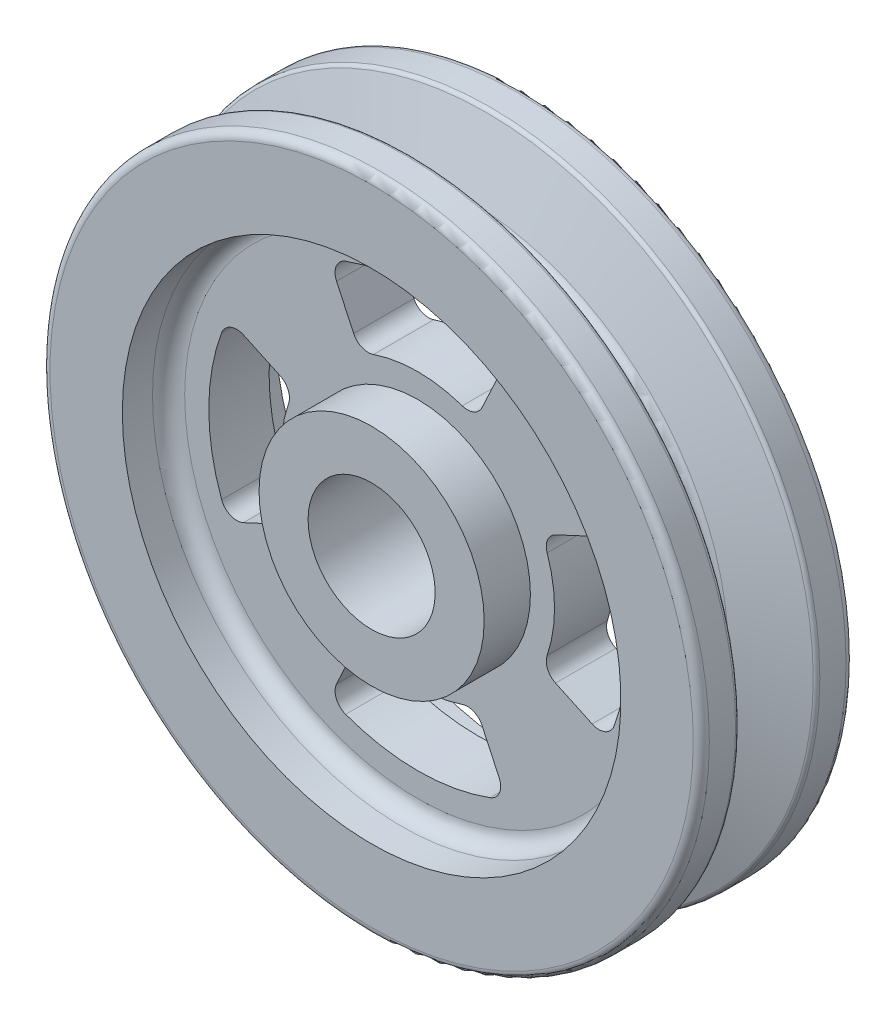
ISO-10303-21;
HEADER;
FILE_DESCRIPTION(('STEP AP214'),'2;1');
FILE_NAME('part.step','',(''),(''),'','','');
FILE_SCHEMA(('AUTOMOTIVE_DESIGN { 1 0 10303 214 1 1 1 1 }'));
ENDSEC;
DATA;
#1=APPLICATION_CONTEXT('core data for automotive mechanical design processes');
#2=APPLICATION_PROTOCOL_DEFINITION('international standard','automotive_design',2000,#1);
#3=PRODUCT_CONTEXT('',#1,'mechanical');
#4=PRODUCT('Part','Part','',(#3));
#5=PRODUCT_RELATED_PRODUCT_CATEGORY('part','',(#4));
#6=PRODUCT_DEFINITION_FORMATION('','',#4);
#7=PRODUCT_DEFINITION_CONTEXT('part definition',#1,'design');
#8=PRODUCT_DEFINITION('design','',#6,#7);
#9=PRODUCT_DEFINITION_SHAPE('','',#8);
#10=(LENGTH_UNIT() NAMED_UNIT(*) SI_UNIT(.MILLI.,.METRE.));
#11=(NAMED_UNIT(*) PLANE_ANGLE_UNIT() SI_UNIT($,.RADIAN.));
#12=(NAMED_UNIT(*) SI_UNIT($,.STERADIAN.) SOLID_ANGLE_UNIT());
#13=UNCERTAINTY_MEASURE_WITH_UNIT(LENGTH_MEASURE(1.E-05),#10,'distance_accuracy_value','');
#14=(GEOMETRIC_REPRESENTATION_CONTEXT(3) GLOBAL_UNCERTAINTY_ASSIGNED_CONTEXT((#13)) GLOBAL_UNIT_ASSIGNED_CONTEXT((#10,
#11,#12)) REPRESENTATION_CONTEXT('',''));
#15=CARTESIAN_POINT('',(0.,0.,0.));
#16=DIRECTION('',(0.,0.,1.));
#17=DIRECTION('',(1.,0.,0.));
#18=AXIS2_PLACEMENT_3D('',#15,#16,#17);
#19=CARTESIAN_POINT('',(0.,0.,9.5));
#20=DIRECTION('',(0.,0.,1.));
#21=DIRECTION('',(1.,0.,0.));
#22=AXIS2_PLACEMENT_3D('',#19,#20,#21);
#23=PLANE('',#22);
#24=CARTESIAN_POINT('',(0.,0.,9.5));
#25=DIRECTION('',(0.,0.,-1.));
#26=DIRECTION('',(-1.,0.,0.));
#27=AXIS2_PLACEMENT_3D('',#24,#25,#26);
#28=CIRCLE('',#27,14.);
#29=CARTESIAN_POINT('',(-14.,0.,9.5));
#30=VERTEX_POINT('',#29);
#31=EDGE_CURVE('E468',#30,#30,#28,.T.);
#32=ORIENTED_EDGE('',*,*,#31,.F.);
#33=EDGE_LOOP('',(#32));
#34=FACE_BOUND('',#33,.T.);
#35=CARTESIAN_POINT('',(0.,0.,9.5));
#36=DIRECTION('',(0.,0.,-1.));
#37=DIRECTION('',(-1.,0.,0.));
#38=AXIS2_PLACEMENT_3D('',#35,#36,#37);
#39=CIRCLE('',#38,7.9);
#40=CARTESIAN_POINT('',(-7.9,0.,9.5));
#41=VERTEX_POINT('',#40);
#42=EDGE_CURVE('E833',#41,#41,#39,.T.);
#43=ORIENTED_EDGE('',*,*,#42,.T.);
#44=EDGE_LOOP('',(#43));
#45=FACE_BOUND('',#44,.T.);
#46=ADVANCED_FACE('F36',(#34,#45),#23,.T.);
#47=CARTESIAN_POINT('',(0.,0.,9.5));
#48=DIRECTION('',(0.,0.,-1.));
#49=DIRECTION('',(-1.,0.,0.));
#50=AXIS2_PLACEMENT_3D('',#47,#48,#49);
#51=CYLINDRICAL_SURFACE('',#50,41.);
#52=CARTESIAN_POINT('',(0.,0.,5.24055444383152));
#53=DIRECTION('',(0.,0.,-1.));
#54=DIRECTION('',(-1.,0.,0.));
#55=AXIS2_PLACEMENT_3D('',#52,#53,#54);
#56=CIRCLE('',#55,41.);
#57=CARTESIAN_POINT('',(-41.,0.,5.24055444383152));
#58=VERTEX_POINT('',#57);
#59=EDGE_CURVE('E665',#58,#58,#56,.F.);
#60=ORIENTED_EDGE('',*,*,#59,.T.);
#61=EDGE_LOOP('',(#60));
#62=FACE_BOUND('',#61,.T.);
#63=CARTESIAN_POINT('',(0.,0.,8.5));
#64=DIRECTION('',(0.,0.,1.));
#65=DIRECTION('',(1.,0.,0.));
#66=AXIS2_PLACEMENT_3D('',#63,#64,#65);
#67=CIRCLE('',#66,41.);
#68=CARTESIAN_POINT('',(41.,0.,8.5));
#69=VERTEX_POINT('',#68);
#70=EDGE_CURVE('E661',#69,#69,#67,.F.);
#71=ORIENTED_EDGE('',*,*,#70,.T.);
#72=EDGE_LOOP('',(#71));
#73=FACE_BOUND('',#72,.T.);
#74=ADVANCED_FACE('F632',(#62,#73),#51,.T.);
#75=CARTESIAN_POINT('',(0.,0.,9.5));
#76=DIRECTION('',(0.,0.,1.));
#77=DIRECTION('',(1.,0.,0.));
#78=AXIS2_PLACEMENT_3D('',#75,#76,#77);
#79=CIRCLE('',#78,40.);
#80=CARTESIAN_POINT('',(40.,0.,9.5));
#81=VERTEX_POINT('',#80);
#82=EDGE_CURVE('E657',#81,#81,#79,.T.);
#83=ORIENTED_EDGE('',*,*,#82,.T.);
#84=EDGE_LOOP('',(#83));
#85=FACE_BOUND('',#84,.T.);
#86=CARTESIAN_POINT('',(0.,0.,9.5));
#87=DIRECTION('',(0.,0.,-1.));
#88=DIRECTION('',(-1.,0.,0.));
#89=AXIS2_PLACEMENT_3D('',#86,#87,#88);
#90=CIRCLE('',#89,31.);
#91=CARTESIAN_POINT('',(-31.,0.,9.5));
#92=VERTEX_POINT('',#91);
#93=EDGE_CURVE('E465',#92,#92,#90,.T.);
#94=ORIENTED_EDGE('',*,*,#93,.T.);
#95=EDGE_LOOP('',(#94));
#96=FACE_BOUND('',#95,.T.);
#97=ADVANCED_FACE('F635',(#85,#96),#23,.T.);
#98=CARTESIAN_POINT('',(0.,0.,4.87728317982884));
#99=DIRECTION('',(0.,0.,1.));
#100=DIRECTION('',(1.,0.,0.));
#101=AXIS2_PLACEMENT_3D('',#98,#99,#100);
#102=CONICAL_SURFACE('',#101,41.,1.25663706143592);
#103=CARTESIAN_POINT('',(0.,0.,4.76502618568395));
#104=DIRECTION('',(0.,0.,1.));
#105=DIRECTION('',(1.,0.,0.));
#106=AXIS2_PLACEMENT_3D('',#103,#104,#105);
#107=CIRCLE('',#106,40.6545084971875);
#108=CARTESIAN_POINT('',(40.6545084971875,0.,4.76502618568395));
#109=VERTEX_POINT('',#108);
#110=EDGE_CURVE('E674',#109,#109,#107,.F.);
#111=ORIENTED_EDGE('',*,*,#110,.T.);
#112=EDGE_LOOP('',(#111));
#113=FACE_BOUND('',#112,.T.);
#114=CARTESIAN_POINT('',(0.,0.,2.1775199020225));
#115=DIRECTION('',(0.,0.,1.));
#116=DIRECTION('',(1.,0.,0.));
#117=AXIS2_PLACEMENT_3D('',#114,#115,#116);
#118=CIRCLE('',#117,32.6909830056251);
#119=CARTESIAN_POINT('',(32.6909830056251,0.,2.1775199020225));
#120=VERTEX_POINT('',#119);
#121=EDGE_CURVE('E764',#120,#120,#118,.T.);
#122=ORIENTED_EDGE('',*,*,#121,.T.);
#123=EDGE_LOOP('',(#122));
#124=FACE_BOUND('',#123,.T.);
#125=ADVANCED_FACE('F647',(#113,#124),#102,.T.);
#126=CARTESIAN_POINT('',(0.,0.,-1.95300591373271));
#127=DIRECTION('',(0.,0.,-1.));
#128=DIRECTION('',(-1.,0.,0.));
#129=AXIS2_PLACEMENT_3D('',#126,#127,#128);
#130=CONICAL_SURFACE('',#129,32.,1.25663706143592);
#131=CARTESIAN_POINT('',(0.,0.,-4.76502618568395));
#132=DIRECTION('',(0.,0.,-1.));
#133=DIRECTION('',(-1.,0.,0.));
#134=AXIS2_PLACEMENT_3D('',#131,#132,#133);
#135=CIRCLE('',#134,40.6545084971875);
#136=CARTESIAN_POINT('',(-40.6545084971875,0.,-4.76502618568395));
#137=VERTEX_POINT('',#136);
#138=EDGE_CURVE('E677',#137,#137,#135,.F.);
#139=ORIENTED_EDGE('',*,*,#138,.T.);
#140=EDGE_LOOP('',(#139));
#141=FACE_BOUND('',#140,.T.);
#142=CARTESIAN_POINT('',(0.,0.,-2.1775199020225));
#143=DIRECTION('',(0.,0.,-1.));
#144=DIRECTION('',(-1.,0.,0.));
#145=AXIS2_PLACEMENT_3D('',#142,#143,#144);
#146=CIRCLE('',#145,32.6909830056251);
#147=CARTESIAN_POINT('',(-32.6909830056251,0.,-2.1775199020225));
#148=VERTEX_POINT('',#147);
#149=EDGE_CURVE('E763',#148,#148,#146,.T.);
#150=ORIENTED_EDGE('',*,*,#149,.T.);
#151=EDGE_LOOP('',(#150));
#152=FACE_BOUND('',#151,.T.);
#153=ADVANCED_FACE('F652',(#141,#152),#130,.T.);
#154=CARTESIAN_POINT('',(0.,0.,9.5));
#155=DIRECTION('',(0.,0.,1.));
#156=DIRECTION('',(1.,0.,0.));
#157=AXIS2_PLACEMENT_3D('',#154,#155,#156);
#158=CYLINDRICAL_SURFACE('',#157,32.);
#159=CARTESIAN_POINT('',(0.,0.,-1.22646338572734));
#160=DIRECTION('',(0.,0.,1.));
#161=DIRECTION('',(1.,0.,0.));
#162=AXIS2_PLACEMENT_3D('',#159,#160,#161);
#163=CIRCLE('',#162,32.);
#164=CARTESIAN_POINT('',(32.,0.,-1.22646338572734));
#165=VERTEX_POINT('',#164);
#166=EDGE_CURVE('E765',#165,#165,#163,.T.);
#167=ORIENTED_EDGE('',*,*,#166,.T.);
#168=EDGE_LOOP('',(#167));
#169=FACE_BOUND('',#168,.T.);
#170=CARTESIAN_POINT('',(0.,0.,1.22646338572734));
#171=DIRECTION('',(0.,0.,1.));
#172=DIRECTION('',(1.,0.,0.));
#173=AXIS2_PLACEMENT_3D('',#170,#171,#172);
#174=CIRCLE('',#173,32.);
#175=CARTESIAN_POINT('',(32.,0.,1.22646338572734));
#176=VERTEX_POINT('',#175);
#177=EDGE_CURVE('E770',#176,#176,#174,.F.);
#178=ORIENTED_EDGE('',*,*,#177,.T.);
#179=EDGE_LOOP('',(#178));
#180=FACE_BOUND('',#179,.T.);
#181=ADVANCED_FACE('F706',(#169,#180),#158,.T.);
#182=CARTESIAN_POINT('',(0.,0.,-9.5));
#183=DIRECTION('',(0.,0.,1.));
#184=DIRECTION('',(1.,0.,0.));
#185=AXIS2_PLACEMENT_3D('',#182,#183,#184);
#186=PLANE('',#185);
#187=CARTESIAN_POINT('',(0.,0.,-9.5));
#188=DIRECTION('',(0.,0.,1.));
#189=DIRECTION('',(1.,0.,0.));
#190=AXIS2_PLACEMENT_3D('',#187,#188,#189);
#191=CIRCLE('',#190,40.);
#192=CARTESIAN_POINT('',(40.,0.,-9.5));
#193=VERTEX_POINT('',#192);
#194=EDGE_CURVE('E662',#193,#193,#191,.F.);
#195=ORIENTED_EDGE('',*,*,#194,.T.);
#196=EDGE_LOOP('',(#195));
#197=FACE_BOUND('',#196,.T.);
#198=CARTESIAN_POINT('',(0.,0.,-9.5));
#199=DIRECTION('',(0.,0.,-1.));
#200=DIRECTION('',(-1.,0.,0.));
#201=AXIS2_PLACEMENT_3D('',#198,#199,#200);
#202=CIRCLE('',#201,31.);
#203=CARTESIAN_POINT('',(-31.,0.,-9.5));
#204=VERTEX_POINT('',#203);
#205=EDGE_CURVE('E474',#204,#204,#202,.T.);
#206=ORIENTED_EDGE('',*,*,#205,.F.);
#207=EDGE_LOOP('',(#206));
#208=FACE_BOUND('',#207,.T.);
#209=ADVANCED_FACE('F704',(#197,#208),#186,.F.);
#210=CARTESIAN_POINT('',(0.,0.,-5.24055444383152));
#211=DIRECTION('',(0.,0.,-1.));
#212=DIRECTION('',(-1.,0.,0.));
#213=AXIS2_PLACEMENT_3D('',#210,#211,#212);
#214=CIRCLE('',#213,41.);
#215=CARTESIAN_POINT('',(-41.,0.,-5.24055444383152));
#216=VERTEX_POINT('',#215);
#217=EDGE_CURVE('E680',#216,#216,#214,.T.);
#218=ORIENTED_EDGE('',*,*,#217,.T.);
#219=EDGE_LOOP('',(#218));
#220=FACE_BOUND('',#219,.T.);
#221=CARTESIAN_POINT('',(0.,0.,-8.5));
#222=DIRECTION('',(0.,0.,1.));
#223=DIRECTION('',(1.,0.,0.));
#224=AXIS2_PLACEMENT_3D('',#221,#222,#223);
#225=CIRCLE('',#224,41.);
#226=CARTESIAN_POINT('',(41.,0.,-8.5));
#227=VERTEX_POINT('',#226);
#228=EDGE_CURVE('E668',#227,#227,#225,.T.);
#229=ORIENTED_EDGE('',*,*,#228,.T.);
#230=EDGE_LOOP('',(#229));
#231=FACE_BOUND('',#230,.T.);
#232=ADVANCED_FACE('F641',(#220,#231),#51,.T.);
#233=CARTESIAN_POINT('',(0.,0.,-28.5));
#234=DIRECTION('',(0.,0.,1.));
#235=DIRECTION('',(1.,0.,0.));
#236=AXIS2_PLACEMENT_3D('',#233,#234,#235);
#237=CYLINDRICAL_SURFACE('',#236,14.);
#238=CARTESIAN_POINT('',(0.,0.,-27.5));
#239=DIRECTION('',(0.,0.,1.));
#240=DIRECTION('',(1.,0.,0.));
#241=AXIS2_PLACEMENT_3D('',#238,#239,#240);
#242=CIRCLE('',#241,14.);
#243=CARTESIAN_POINT('',(14.,0.,-27.5));
#244=VERTEX_POINT('',#243);
#245=EDGE_CURVE('E782',#244,#244,#242,.T.);
#246=ORIENTED_EDGE('',*,*,#245,.T.);
#247=EDGE_LOOP('',(#246));
#248=FACE_BOUND('',#247,.T.);
#249=CARTESIAN_POINT('',(0.,14.,-23.5));
#250=CARTESIAN_POINT('',(-0.139239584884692,13.9999975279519,-23.4999945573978));
#251=CARTESIAN_POINT('',(-0.278551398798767,13.9979012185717,-23.4883280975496));
#252=CARTESIAN_POINT('',(-0.553257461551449,13.9897405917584,-23.4419958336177));
#253=CARTESIAN_POINT('',(-0.688648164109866,13.9836727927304,-23.4073098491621));
#254=CARTESIAN_POINT('',(-0.951498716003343,13.9682487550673,-23.316027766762));
#255=CARTESIAN_POINT('',(-1.07896532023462,13.9588953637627,-23.2594506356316));
#256=CARTESIAN_POINT('',(-1.32258294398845,13.9379246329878,-23.1260443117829));
#257=CARTESIAN_POINT('',(-1.43873504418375,13.9263075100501,-23.0492170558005));
#258=CARTESIAN_POINT('',(-1.65770744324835,13.9019523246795,-22.8766007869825));
#259=CARTESIAN_POINT('',(-1.76038642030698,13.8892044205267,-22.7806338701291));
#260=CARTESIAN_POINT('',(-1.94827611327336,13.8640984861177,-22.5728452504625));
#261=CARTESIAN_POINT('',(-2.03348564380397,13.851740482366,-22.4610224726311));
#262=CARTESIAN_POINT('',(-2.18459604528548,13.828718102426,-22.2237098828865));
#263=CARTESIAN_POINT('',(-2.25035491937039,13.8180664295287,-22.098128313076));
#264=CARTESIAN_POINT('',(-2.35978878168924,13.799800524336,-21.8374788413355));
#265=CARTESIAN_POINT('',(-2.40346549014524,13.7921860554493,-21.7024116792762));
#266=CARTESIAN_POINT('',(-2.46704527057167,13.7809553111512,-21.4281311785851));
#267=CARTESIAN_POINT('',(-2.48719373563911,13.7772977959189,-21.2889764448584));
#268=CARTESIAN_POINT('',(-2.50390640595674,13.7742705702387,-21.0092170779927));
#269=CARTESIAN_POINT('',(-2.50047252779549,13.7749005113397,-20.8686125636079));
#270=CARTESIAN_POINT('',(-2.47031736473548,13.78033942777,-20.5917111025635));
#271=CARTESIAN_POINT('',(-2.44387361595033,13.7850985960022,-20.4553828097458));
#272=CARTESIAN_POINT('',(-2.3688857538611,13.7981816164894,-20.1891293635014));
#273=CARTESIAN_POINT('',(-2.32034078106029,13.8065056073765,-20.0592044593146));
#274=CARTESIAN_POINT('',(-2.2022526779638,13.8258332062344,-19.8086255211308));
#275=CARTESIAN_POINT('',(-2.13259607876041,13.836851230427,-19.6880261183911));
#276=CARTESIAN_POINT('',(-1.97434240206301,13.8603157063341,-19.4601224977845));
#277=CARTESIAN_POINT('',(-1.88574357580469,13.8727622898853,-19.3528195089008));
#278=CARTESIAN_POINT('',(-1.69061708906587,13.8978993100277,-19.1529497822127));
#279=CARTESIAN_POINT('',(-1.58385171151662,13.9105906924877,-19.0606150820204));
#280=CARTESIAN_POINT('',(-1.35622200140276,13.934623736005,-18.895133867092));
#281=CARTESIAN_POINT('',(-1.23535755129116,13.9459653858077,-18.8219875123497));
#282=CARTESIAN_POINT('',(-0.982729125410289,13.9660408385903,-18.6969309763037));
#283=CARTESIAN_POINT('',(-0.850953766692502,13.9747718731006,-18.6450433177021));
#284=CARTESIAN_POINT('',(-0.58036740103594,13.9886206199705,-18.564203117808));
#285=CARTESIAN_POINT('',(-0.44155707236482,13.9937386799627,-18.5352483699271));
#286=CARTESIAN_POINT('',(-0.162838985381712,13.999737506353,-18.501415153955));
#287=CARTESIAN_POINT('',(-0.0229710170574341,14.0006742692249,-18.496218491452));
#288=CARTESIAN_POINT('',(0.255635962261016,13.9983590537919,-18.5091977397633));
#289=CARTESIAN_POINT('',(0.394375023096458,13.9951072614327,-18.5273726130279));
#290=CARTESIAN_POINT('',(0.665788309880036,13.9848150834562,-18.5863143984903));
#291=CARTESIAN_POINT('',(0.798498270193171,13.9778014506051,-18.6269218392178));
#292=CARTESIAN_POINT('',(1.0552266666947,13.960768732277,-18.7294046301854));
#293=CARTESIAN_POINT('',(1.1792445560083,13.9507494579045,-18.7912813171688));
#294=CARTESIAN_POINT('',(1.4164370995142,13.9286773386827,-18.9352612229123));
#295=CARTESIAN_POINT('',(1.52949072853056,13.9166051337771,-19.0175607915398));
#296=CARTESIAN_POINT('',(1.74029662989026,13.8918196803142,-19.1997826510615));
#297=CARTESIAN_POINT('',(1.8380476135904,13.8791063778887,-19.2997064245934));
#298=CARTESIAN_POINT('',(2.01666949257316,13.8542878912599,-19.5157749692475));
#299=CARTESIAN_POINT('',(2.09732417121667,13.8421918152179,-19.6320997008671));
#300=CARTESIAN_POINT('',(2.23794827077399,13.8201546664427,-19.8768336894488));
#301=CARTESIAN_POINT('',(2.29791841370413,13.8102135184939,-20.0052425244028));
#302=CARTESIAN_POINT('',(2.39515706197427,13.7936819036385,-20.2699261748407));
#303=CARTESIAN_POINT('',(2.43252842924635,13.7870762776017,-20.4061622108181));
#304=CARTESIAN_POINT('',(2.48382895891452,13.7779274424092,-20.6831072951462));
#305=CARTESIAN_POINT('',(2.49776049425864,13.7753838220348,-20.8238158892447));
#306=CARTESIAN_POINT('',(2.50171229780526,13.7746664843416,-21.1035492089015));
#307=CARTESIAN_POINT('',(2.49207328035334,13.7764304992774,-21.2425690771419));
#308=CARTESIAN_POINT('',(2.44989946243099,13.7839923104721,-21.5169738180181));
#309=CARTESIAN_POINT('',(2.4173647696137,13.7897900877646,-21.6523587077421));
#310=CARTESIAN_POINT('',(2.3304611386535,13.8047410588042,-21.9154898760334));
#311=CARTESIAN_POINT('',(2.27612576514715,13.8138890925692,-22.0432475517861));
#312=CARTESIAN_POINT('',(2.14719934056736,13.8345140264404,-22.2878884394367));
#313=CARTESIAN_POINT('',(2.07260704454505,13.8459910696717,-22.4047709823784));
#314=CARTESIAN_POINT('',(1.90408567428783,13.8701759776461,-22.62605704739));
#315=CARTESIAN_POINT('',(1.80990741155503,13.882898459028,-22.7302692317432));
#316=CARTESIAN_POINT('',(1.60540999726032,13.9080282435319,-22.9215258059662));
#317=CARTESIAN_POINT('',(1.49508713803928,13.920435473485,-23.0085662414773));
#318=CARTESIAN_POINT('',(1.26037074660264,13.9436534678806,-23.1636577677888));
#319=CARTESIAN_POINT('',(1.13587103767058,13.9544505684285,-23.2315502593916));
#320=CARTESIAN_POINT('',(0.877084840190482,13.9730987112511,-23.3453492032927));
#321=CARTESIAN_POINT('',(0.742807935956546,13.9809525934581,-23.3912768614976));
#322=CARTESIAN_POINT('',(0.506731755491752,13.9911779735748,-23.4502306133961));
#323=CARTESIAN_POINT('',(0.406334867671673,13.9944679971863,-23.4688631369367));
#324=CARTESIAN_POINT('',(0.203971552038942,13.9988798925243,-23.4937496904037));
#325=CARTESIAN_POINT('',(0.102005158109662,14.0000018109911,-23.5000039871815));
#326=CARTESIAN_POINT('',(0.,14.,-23.5));
#327=B_SPLINE_CURVE_WITH_KNOTS('',3,(#249,#250,#251,#252,#253,#254,#255,#256,#257,#258,#259,
#260,#261,#262,#263,#264,#265,#266,#267,#268,#269,#270,#271,#272,#273,#274,#275,#276,#277,#278,
#279,#280,#281,#282,#283,#284,#285,#286,#287,#288,#289,#290,#291,#292,#293,#294,#295,#296,#297,
#298,#299,#300,#301,#302,#303,#304,#305,#306,#307,#308,#309,#310,#311,#312,#313,#314,#315,#316,
#317,#318,#319,#320,#321,#322,#323,#324,#325,#326),.UNSPECIFIED.,.T.,.F.,(4,2,2,2,2,2,2,2,2,2,2,
2,2,2,2,2,2,2,2,2,2,2,2,2,2,2,2,2,2,2,2,2,2,2,2,2,2,2,4),(0.,0.417345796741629,
0.835057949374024,1.25240899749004,1.66972014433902,2.09110796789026,2.5125243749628,
2.93694536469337,3.36133328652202,3.78125426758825,4.20114112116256,4.61603258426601,
5.03094018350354,5.44811857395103,5.8653354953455,6.28850377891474,6.71167559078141,
7.13529458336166,7.55887281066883,7.97676106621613,8.39463077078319,8.80956740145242,
9.2245301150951,9.6436484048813,10.062801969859,10.4869762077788,10.9111356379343,
11.3333496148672,11.7555208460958,12.1716257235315,12.5877286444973,13.0031933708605,
13.4186836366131,13.8398246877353,14.2610626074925,14.6856934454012,15.109913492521,
15.4156623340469,15.7214045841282),.UNSPECIFIED.);
#328=CARTESIAN_POINT('',(0.,14.,-23.5));
#329=VERTEX_POINT('',#328);
#330=EDGE_CURVE('E477',#329,#329,#327,.T.);
#331=ORIENTED_EDGE('',*,*,#330,.F.);
#332=EDGE_LOOP('',(#331));
#333=FACE_BOUND('',#332,.T.);
#334=CARTESIAN_POINT('',(0.,0.,-3.74999999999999));
#335=DIRECTION('',(0.,0.,-1.));
#336=DIRECTION('',(-1.,0.,0.));
#337=AXIS2_PLACEMENT_3D('',#334,#335,#336);
#338=CIRCLE('',#337,14.);
#339=CARTESIAN_POINT('',(-14.,0.,-3.74999999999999));
#340=VERTEX_POINT('',#339);
#341=EDGE_CURVE('E471',#340,#340,#338,.T.);
#342=ORIENTED_EDGE('',*,*,#341,.T.);
#343=EDGE_LOOP('',(#342));
#344=FACE_BOUND('',#343,.T.);
#345=ADVANCED_FACE('F712',(#248,#333,#344),#237,.T.);
#346=CARTESIAN_POINT('',(0.,0.,-28.5));
#347=DIRECTION('',(0.,0.,1.));
#348=DIRECTION('',(1.,0.,0.));
#349=AXIS2_PLACEMENT_3D('',#346,#347,#348);
#350=PLANE('',#349);
#351=CARTESIAN_POINT('',(0.,0.,-28.5));
#352=DIRECTION('',(0.,0.,1.));
#353=DIRECTION('',(1.,0.,0.));
#354=AXIS2_PLACEMENT_3D('',#351,#352,#353);
#355=CIRCLE('',#354,13.);
#356=CARTESIAN_POINT('',(13.,0.,-28.5));
#357=VERTEX_POINT('',#356);
#358=EDGE_CURVE('E779',#357,#357,#355,.F.);
#359=ORIENTED_EDGE('',*,*,#358,.T.);
#360=EDGE_LOOP('',(#359));
#361=FACE_BOUND('',#360,.T.);
#362=CARTESIAN_POINT('',(0.,0.,-28.5));
#363=DIRECTION('',(0.,0.,-1.));
#364=DIRECTION('',(-1.,0.,0.));
#365=AXIS2_PLACEMENT_3D('',#362,#363,#364);
#366=CIRCLE('',#365,7.9);
#367=CARTESIAN_POINT('',(-7.9,0.,-28.5));
#368=VERTEX_POINT('',#367);
#369=EDGE_CURVE('E834',#368,#368,#366,.T.);
#370=ORIENTED_EDGE('',*,*,#369,.F.);
#371=EDGE_LOOP('',(#370));
#372=FACE_BOUND('',#371,.T.);
#373=ADVANCED_FACE('F841',(#361,#372),#350,.F.);
#374=CARTESIAN_POINT('',(0.,0.,9.5));
#375=DIRECTION('',(0.,0.,-1.));
#376=DIRECTION('',(-1.,0.,0.));
#377=AXIS2_PLACEMENT_3D('',#374,#375,#376);
#378=CYLINDRICAL_SURFACE('',#377,7.9);
#379=CARTESIAN_POINT('',(0.,7.9,-23.5));
#380=CARTESIAN_POINT('',(-0.136791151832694,7.89999949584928,-23.499999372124));
#381=CARTESIAN_POINT('',(-0.273589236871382,7.89641372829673,-23.4887359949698));
#382=CARTESIAN_POINT('',(-0.543179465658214,7.88246103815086,-23.4441018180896));
#383=CARTESIAN_POINT('',(-0.675970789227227,7.87209273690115,-23.4107265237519));
#384=CARTESIAN_POINT('',(-0.933621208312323,7.84570652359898,-23.3231105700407));
#385=CARTESIAN_POINT('',(-1.05849240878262,7.82969749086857,-23.2689026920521));
#386=CARTESIAN_POINT('',(-1.29737253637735,7.79367923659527,-23.1413014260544));
#387=CARTESIAN_POINT('',(-1.41137966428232,7.77366935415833,-23.0679048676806));
#388=CARTESIAN_POINT('',(-1.62889685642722,7.73106311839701,-22.9015703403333));
#389=CARTESIAN_POINT('',(-1.7320157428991,7.70840935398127,-22.8081355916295));
#390=CARTESIAN_POINT('',(-1.92141277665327,7.66339795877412,-22.6054343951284));
#391=CARTESIAN_POINT('',(-2.00768768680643,7.64104038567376,-22.4961649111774));
#392=CARTESIAN_POINT('',(-2.16308938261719,7.59853387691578,-22.2614845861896));
#393=CARTESIAN_POINT('',(-2.23172383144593,7.57845563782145,-22.1357337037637));
#394=CARTESIAN_POINT('',(-2.34670720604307,7.54364637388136,-21.8737361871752));
#395=CARTESIAN_POINT('',(-2.39306217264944,7.52891389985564,-21.7374924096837));
#396=CARTESIAN_POINT('',(-2.46073265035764,7.50706549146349,-21.4627973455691));
#397=CARTESIAN_POINT('',(-2.48277519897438,7.49972900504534,-21.3245431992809));
#398=CARTESIAN_POINT('',(-2.50346680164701,7.49284884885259,-21.0461193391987));
#399=CARTESIAN_POINT('',(-2.50212225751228,7.49330304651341,-20.9059501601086));
#400=CARTESIAN_POINT('',(-2.47664570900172,7.50175851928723,-20.6337230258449));
#401=CARTESIAN_POINT('',(-2.4534423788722,7.50945220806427,-20.5015669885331));
#402=CARTESIAN_POINT('',(-2.38641434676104,7.53101942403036,-20.2431295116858));
#403=CARTESIAN_POINT('',(-2.342587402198,7.54489362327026,-20.1168487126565));
#404=CARTESIAN_POINT('',(-2.23490939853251,7.57749121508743,-19.8715531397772));
#405=CARTESIAN_POINT('',(-2.17076980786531,7.59628375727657,-19.7526746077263));
#406=CARTESIAN_POINT('',(-2.02448755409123,7.63656941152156,-19.5270651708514));
#407=CARTESIAN_POINT('',(-1.94234011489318,7.65806323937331,-19.4203375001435));
#408=CARTESIAN_POINT('',(-1.75783492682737,7.70255919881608,-19.216814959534));
#409=CARTESIAN_POINT('',(-1.6547118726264,7.72558486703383,-19.1207177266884));
#410=CARTESIAN_POINT('',(-1.43352803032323,7.76966518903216,-18.9470088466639));
#411=CARTESIAN_POINT('',(-1.3154660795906,7.79071968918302,-18.8693986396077));
#412=CARTESIAN_POINT('',(-1.06638636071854,7.82871626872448,-18.7343779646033));
#413=CARTESIAN_POINT('',(-0.935270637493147,7.84562334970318,-18.6771376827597));
#414=CARTESIAN_POINT('',(-0.664611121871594,7.87316726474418,-18.5857346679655));
#415=CARTESIAN_POINT('',(-0.52506997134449,7.88380605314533,-18.5515647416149));
#416=CARTESIAN_POINT('',(-0.24743946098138,7.89729847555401,-18.5084695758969));
#417=CARTESIAN_POINT('',(-0.109510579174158,7.9004430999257,-18.4986002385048));
#418=CARTESIAN_POINT('',(0.166049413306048,7.89945574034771,-18.5017194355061));
#419=CARTESIAN_POINT('',(0.303680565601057,7.89532484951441,-18.5147045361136));
#420=CARTESIAN_POINT('',(0.571071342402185,7.88044201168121,-18.5624079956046));
#421=CARTESIAN_POINT('',(0.700942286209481,7.86986232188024,-18.5965613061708));
#422=CARTESIAN_POINT('',(0.953071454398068,7.84332445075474,-18.684939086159));
#423=CARTESIAN_POINT('',(1.07532872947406,7.8273656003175,-18.7391660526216));
#424=CARTESIAN_POINT('',(1.31212842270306,7.79121492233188,-18.8676506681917));
#425=CARTESIAN_POINT('',(1.42640486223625,7.77092806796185,-18.9423710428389));
#426=CARTESIAN_POINT('',(1.64111203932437,7.7284377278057,-19.1091684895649));
#427=CARTESIAN_POINT('',(1.74153891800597,7.70623371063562,-19.2012503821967));
#428=CARTESIAN_POINT('',(1.92994114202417,7.66127259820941,-19.404598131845));
#429=CARTESIAN_POINT('',(2.01724334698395,7.6385297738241,-19.5164922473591));
#430=CARTESIAN_POINT('',(2.17189637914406,7.59600692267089,-19.7538359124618));
#431=CARTESIAN_POINT('',(2.2392474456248,7.57622686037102,-19.8792852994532));
#432=CARTESIAN_POINT('',(2.35168434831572,7.54208472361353,-20.1399710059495));
#433=CARTESIAN_POINT('',(2.39684978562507,7.52770332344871,-20.2751703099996));
#434=CARTESIAN_POINT('',(2.46360441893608,7.50612469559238,-20.5518058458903));
#435=CARTESIAN_POINT('',(2.4852028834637,7.49892464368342,-20.6932396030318));
#436=CARTESIAN_POINT('',(2.50353387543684,7.49282329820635,-20.9712777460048));
#437=CARTESIAN_POINT('',(2.5013730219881,7.49355266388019,-21.1078019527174));
#438=CARTESIAN_POINT('',(2.47492780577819,7.50232777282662,-21.3784388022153));
#439=CARTESIAN_POINT('',(2.45064452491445,7.51037315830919,-21.5125515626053));
#440=CARTESIAN_POINT('',(2.38139274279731,7.53261247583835,-21.7725242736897));
#441=CARTESIAN_POINT('',(2.33674860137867,7.54670979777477,-21.8984795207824));
#442=CARTESIAN_POINT('',(2.22829899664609,7.57943777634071,-22.1412117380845));
#443=CARTESIAN_POINT('',(2.16448956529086,7.59806937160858,-22.2579868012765));
#444=CARTESIAN_POINT('',(2.01653844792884,7.6386957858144,-22.4840986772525));
#445=CARTESIAN_POINT('',(1.93168589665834,7.66079528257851,-22.5929514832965));
#446=CARTESIAN_POINT('',(1.74529886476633,7.70539432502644,-22.7952313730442));
#447=CARTESIAN_POINT('',(1.64375987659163,7.7278939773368,-22.8886542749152));
#448=CARTESIAN_POINT('',(1.42275530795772,7.77167044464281,-23.0605868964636));
#449=CARTESIAN_POINT('',(1.30279989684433,7.79288024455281,-23.1384859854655));
#450=CARTESIAN_POINT('',(1.05082666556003,7.83083384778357,-23.2729131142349));
#451=CARTESIAN_POINT('',(0.918813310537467,7.84757929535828,-23.3294490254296));
#452=CARTESIAN_POINT('',(0.656990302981,7.87364691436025,-23.4157553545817));
#453=CARTESIAN_POINT('',(0.527796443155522,7.883442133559,-23.4472542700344));
#454=CARTESIAN_POINT('',(0.265736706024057,7.8966182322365,-23.4893746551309));
#455=CARTESIAN_POINT('',(0.132871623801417,7.9000004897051,-23.5000006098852));
#456=CARTESIAN_POINT('',(0.,7.9,-23.5));
#457=B_SPLINE_CURVE_WITH_KNOTS('',3,(#379,#380,#381,#382,#383,#384,#385,#386,#387,#388,#389,
#390,#391,#392,#393,#394,#395,#396,#397,#398,#399,#400,#401,#402,#403,#404,#405,#406,#407,#408,
#409,#410,#411,#412,#413,#414,#415,#416,#417,#418,#419,#420,#421,#422,#423,#424,#425,#426,#427,
#428,#429,#430,#431,#432,#433,#434,#435,#436,#437,#438,#439,#440,#441,#442,#443,#444,#445,#446,
#447,#448,#449,#450,#451,#452,#453,#454,#455,#456),.UNSPECIFIED.,.T.,.F.,(4,2,2,2,2,2,2,2,2,2,2,
2,2,2,2,2,2,2,2,2,2,2,2,2,2,2,2,2,2,2,2,2,2,2,2,2,2,2,4),(0.,0.409884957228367,
0.819853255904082,1.22917906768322,1.63857255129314,2.05961951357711,2.48074731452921,
2.91259353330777,3.34432259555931,3.76275836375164,4.18107959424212,4.58239346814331,
4.98375099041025,5.39108664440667,5.79853046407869,6.22502266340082,6.65154807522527,
7.08155767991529,7.51143314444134,7.92432382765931,8.33715248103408,8.73940964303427,
9.14171686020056,9.55398543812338,9.96636865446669,10.3955360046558,10.8246982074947,
11.2523091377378,11.6797518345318,12.0873735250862,12.4949752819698,12.8962990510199,
13.2977059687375,13.7151604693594,14.132727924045,14.5644059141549,14.9959246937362,
15.3941506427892,15.7922910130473),.UNSPECIFIED.);
#458=CARTESIAN_POINT('',(0.,7.9,-23.5));
#459=VERTEX_POINT('',#458);
#460=EDGE_CURVE('E484',#459,#459,#457,.T.);
#461=ORIENTED_EDGE('',*,*,#460,.T.);
#462=EDGE_LOOP('',(#461));
#463=FACE_BOUND('',#462,.T.);
#464=ORIENTED_EDGE('',*,*,#42,.F.);
#465=EDGE_LOOP('',(#464));
#466=FACE_BOUND('',#465,.T.);
#467=ORIENTED_EDGE('',*,*,#369,.T.);
#468=EDGE_LOOP('',(#467));
#469=FACE_BOUND('',#468,.T.);
#470=ADVANCED_FACE('F495',(#463,#466,#469),#378,.F.);
#471=CARTESIAN_POINT('',(0.,0.,-21.));
#472=DIRECTION('',(0.,-1.,0.));
#473=DIRECTION('',(0.,0.,-1.));
#474=AXIS2_PLACEMENT_3D('',#471,#472,#473);
#475=CYLINDRICAL_SURFACE('',#474,2.5);
#476=ORIENTED_EDGE('',*,*,#330,.T.);
#477=EDGE_LOOP('',(#476));
#478=FACE_BOUND('',#477,.T.);
#479=ORIENTED_EDGE('',*,*,#460,.F.);
#480=EDGE_LOOP('',(#479));
#481=FACE_BOUND('',#480,.T.);
#482=ADVANCED_FACE('F490',(#478,#481),#475,.F.);
#483=CARTESIAN_POINT('',(0.,0.,-28.5));
#484=DIRECTION('',(0.,0.,-1.));
#485=DIRECTION('',(-1.,0.,0.));
#486=AXIS2_PLACEMENT_3D('',#483,#484,#485);
#487=CYLINDRICAL_SURFACE('',#486,31.);
#488=CARTESIAN_POINT('',(0.,0.,-5.74999999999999));
#489=DIRECTION('',(0.,0.,1.));
#490=DIRECTION('',(1.,0.,0.));
#491=AXIS2_PLACEMENT_3D('',#488,#489,#490);
#492=CIRCLE('',#491,31.);
#493=CARTESIAN_POINT('',(31.,0.,-5.74999999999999));
#494=VERTEX_POINT('',#493);
#495=EDGE_CURVE('E11',#494,#494,#492,.T.);
#496=ORIENTED_EDGE('',*,*,#495,.T.);
#497=EDGE_LOOP('',(#496));
#498=FACE_BOUND('',#497,.T.);
#499=ORIENTED_EDGE('',*,*,#205,.T.);
#500=EDGE_LOOP('',(#499));
#501=FACE_BOUND('',#500,.T.);
#502=ADVANCED_FACE('F494',(#498,#501),#487,.F.);
#503=CARTESIAN_POINT('',(0.,31.,-3.74999999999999));
#504=DIRECTION('',(0.,0.,1.));
#505=DIRECTION('',(1.,0.,0.));
#506=AXIS2_PLACEMENT_3D('',#503,#504,#505);
#507=PLANE('',#506);
#508=CARTESIAN_POINT('',(0.,0.,-3.74999999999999));
#509=DIRECTION('',(0.,0.,1.));
#510=DIRECTION('',(1.,0.,0.));
#511=AXIS2_PLACEMENT_3D('',#508,#509,#510);
#512=CIRCLE('',#511,29.);
#513=CARTESIAN_POINT('',(29.,0.,-3.74999999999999));
#514=VERTEX_POINT('',#513);
#515=EDGE_CURVE('E44',#514,#514,#512,.F.);
#516=ORIENTED_EDGE('',*,*,#515,.T.);
#517=EDGE_LOOP('',(#516));
#518=FACE_BOUND('',#517,.T.);
#519=CARTESIAN_POINT('',(-6.17252134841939,-17.9694179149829,-3.74999999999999));
#520=DIRECTION('',(0.,0.,1.));
#521=DIRECTION('',(0.,1.,0.));
#522=AXIS2_PLACEMENT_3D('',#519,#520,#521);
#523=CIRCLE('',#522,2.);
#524=CARTESIAN_POINT('',(-5.52278225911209,-16.0779002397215,-3.74999999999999));
#525=VERTEX_POINT('',#524);
#526=CARTESIAN_POINT('',(-7.98513692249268,-17.1241813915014,-3.74999999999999));
#527=VERTEX_POINT('',#526);
#528=EDGE_CURVE('E307',#525,#527,#523,.T.);
#529=ORIENTED_EDGE('',*,*,#528,.T.);
#530=DIRECTION('',(0.42261826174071,0.906307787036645,0.));
#531=VECTOR('',#530,1.);
#532=CARTESIAN_POINT('',(-7.18451044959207,-15.407232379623,-3.74999999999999));
#533=LINE('',#532,#531);
#534=CARTESIAN_POINT('',(-10.1075587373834,-21.6757296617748,-3.74999999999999));
#535=VERTEX_POINT('',#534);
#536=EDGE_CURVE('E310',#535,#527,#533,.T.);
#537=ORIENTED_EDGE('',*,*,#536,.F.);
#538=CARTESIAN_POINT('',(-8.29494316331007,-22.5209661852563,-3.74999999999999));
#539=DIRECTION('',(0.,0.,1.));
#540=DIRECTION('',(0.,1.,0.));
#541=AXIS2_PLACEMENT_3D('',#538,#539,#540);
#542=CIRCLE('',#541,2.);
#543=CARTESIAN_POINT('',(-8.98618842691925,-24.3977133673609,-3.74999999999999));
#544=VERTEX_POINT('',#543);
#545=EDGE_CURVE('E254',#535,#544,#542,.T.);
#546=ORIENTED_EDGE('',*,*,#545,.T.);
#547=CARTESIAN_POINT('',(0.,0.,-3.74999999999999));
#548=DIRECTION('',(0.,0.,-1.));
#549=DIRECTION('',(0.,-1.,0.));
#550=AXIS2_PLACEMENT_3D('',#547,#548,#549);
#551=CIRCLE('',#550,26.);
#552=CARTESIAN_POINT('',(8.98618842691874,-24.3977133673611,-3.74999999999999));
#553=VERTEX_POINT('',#552);
#554=EDGE_CURVE('E51',#553,#544,#551,.T.);
#555=ORIENTED_EDGE('',*,*,#554,.F.);
#556=CARTESIAN_POINT('',(8.2949431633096,-22.5209661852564,-3.74999999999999));
#557=DIRECTION('',(0.,0.,1.));
#558=DIRECTION('',(0.,1.,0.));
#559=AXIS2_PLACEMENT_3D('',#556,#557,#558);
#560=CIRCLE('',#559,2.);
#561=CARTESIAN_POINT('',(10.1075587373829,-21.675729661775,-3.74999999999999));
#562=VERTEX_POINT('',#561);
#563=EDGE_CURVE('E275',#553,#562,#560,.T.);
#564=ORIENTED_EDGE('',*,*,#563,.T.);
#565=DIRECTION('',(0.422618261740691,-0.906307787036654,0.));
#566=VECTOR('',#565,1.);
#567=CARTESIAN_POINT('',(7.18451044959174,-15.4072323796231,-3.74999999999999));
#568=LINE('',#567,#566);
#569=CARTESIAN_POINT('',(7.98513692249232,-17.1241813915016,-3.74999999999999));
#570=VERTEX_POINT('',#569);
#571=EDGE_CURVE('E282',#570,#562,#568,.T.);
#572=ORIENTED_EDGE('',*,*,#571,.F.);
#573=CARTESIAN_POINT('',(6.17252134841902,-17.969417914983,-3.74999999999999));
#574=DIRECTION('',(0.,0.,1.));
#575=DIRECTION('',(0.,1.,0.));
#576=AXIS2_PLACEMENT_3D('',#573,#574,#575);
#577=CIRCLE('',#576,2.);
#578=CARTESIAN_POINT('',(5.52278225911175,-16.0779002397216,-3.74999999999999));
#579=VERTEX_POINT('',#578);
#580=EDGE_CURVE('E291',#570,#579,#577,.T.);
#581=ORIENTED_EDGE('',*,*,#580,.T.);
#582=CARTESIAN_POINT('',(0.,0.,-3.74999999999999));
#583=DIRECTION('',(0.,0.,1.));
#584=DIRECTION('',(0.,-1.,0.));
#585=AXIS2_PLACEMENT_3D('',#582,#583,#584);
#586=CIRCLE('',#585,17.);
#587=EDGE_CURVE('E299',#525,#579,#586,.T.);
#588=ORIENTED_EDGE('',*,*,#587,.F.);
#589=EDGE_LOOP('',(#529,#537,#546,#555,#564,#572,#581,#588));
#590=FACE_BOUND('',#589,.T.);
#591=CARTESIAN_POINT('',(17.9694179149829,-6.1725213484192,-3.74999999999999));
#592=DIRECTION('',(0.,0.,1.));
#593=DIRECTION('',(-1.,0.,0.));
#594=AXIS2_PLACEMENT_3D('',#591,#592,#593);
#595=CIRCLE('',#594,2.);
#596=CARTESIAN_POINT('',(16.0779002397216,-5.52278225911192,-3.74999999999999));
#597=VERTEX_POINT('',#596);
#598=CARTESIAN_POINT('',(17.1241813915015,-7.9851369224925,-3.74999999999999));
#599=VERTEX_POINT('',#598);
#600=EDGE_CURVE('E373',#597,#599,#595,.T.);
#601=ORIENTED_EDGE('',*,*,#600,.T.);
#602=DIRECTION('',(-0.906307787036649,0.422618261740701,0.));
#603=VECTOR('',#602,1.);
#604=CARTESIAN_POINT('',(15.407232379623,-7.18451044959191,-3.74999999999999));
#605=LINE('',#604,#603);
#606=CARTESIAN_POINT('',(21.6757296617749,-10.1075587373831,-3.74999999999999));
#607=VERTEX_POINT('',#606);
#608=EDGE_CURVE('E376',#607,#599,#605,.T.);
#609=ORIENTED_EDGE('',*,*,#608,.F.);
#610=CARTESIAN_POINT('',(22.5209661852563,-8.29494316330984,-3.74999999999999));
#611=DIRECTION('',(0.,0.,1.));
#612=DIRECTION('',(-1.,0.,0.));
#613=AXIS2_PLACEMENT_3D('',#610,#611,#612);
#614=CIRCLE('',#613,2.);
#615=CARTESIAN_POINT('',(24.397713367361,-8.98618842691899,-3.74999999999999));
#616=VERTEX_POINT('',#615);
#617=EDGE_CURVE('E317',#607,#616,#614,.T.);
#618=ORIENTED_EDGE('',*,*,#617,.T.);
#619=CARTESIAN_POINT('',(0.,0.,-3.74999999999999));
#620=DIRECTION('',(0.,0.,-1.));
#621=DIRECTION('',(1.,0.,0.));
#622=AXIS2_PLACEMENT_3D('',#619,#620,#621);
#623=CIRCLE('',#622,26.);
#624=CARTESIAN_POINT('',(24.397713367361,8.98618842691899,-3.74999999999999));
#625=VERTEX_POINT('',#624);
#626=EDGE_CURVE('E331',#625,#616,#623,.T.);
#627=ORIENTED_EDGE('',*,*,#626,.F.);
#628=CARTESIAN_POINT('',(22.5209661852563,8.29494316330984,-3.74999999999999));
#629=DIRECTION('',(0.,0.,1.));
#630=DIRECTION('',(-1.,0.,0.));
#631=AXIS2_PLACEMENT_3D('',#628,#629,#630);
#632=CIRCLE('',#631,2.);
#633=CARTESIAN_POINT('',(21.6757296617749,10.1075587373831,-3.74999999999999));
#634=VERTEX_POINT('',#633);
#635=EDGE_CURVE('E339',#625,#634,#632,.T.);
#636=ORIENTED_EDGE('',*,*,#635,.T.);
#637=DIRECTION('',(0.90630778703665,0.4226182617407,0.));
#638=VECTOR('',#637,1.);
#639=CARTESIAN_POINT('',(15.407232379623,7.18451044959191,-3.74999999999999));
#640=LINE('',#639,#638);
#641=CARTESIAN_POINT('',(17.1241813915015,7.9851369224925,-3.74999999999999));
#642=VERTEX_POINT('',#641);
#643=EDGE_CURVE('E347',#642,#634,#640,.T.);
#644=ORIENTED_EDGE('',*,*,#643,.F.);
#645=CARTESIAN_POINT('',(17.9694179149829,6.1725213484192,-3.74999999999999));
#646=DIRECTION('',(0.,0.,1.));
#647=DIRECTION('',(-1.,0.,0.));
#648=AXIS2_PLACEMENT_3D('',#645,#646,#647);
#649=CIRCLE('',#648,2.);
#650=CARTESIAN_POINT('',(16.0779002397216,5.52278225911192,-3.74999999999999));
#651=VERTEX_POINT('',#650);
#652=EDGE_CURVE('E356',#642,#651,#649,.T.);
#653=ORIENTED_EDGE('',*,*,#652,.T.);
#654=CARTESIAN_POINT('',(0.,0.,-3.74999999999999));
#655=DIRECTION('',(0.,0.,1.));
#656=DIRECTION('',(1.,0.,0.));
#657=AXIS2_PLACEMENT_3D('',#654,#655,#656);
#658=CIRCLE('',#657,17.);
#659=EDGE_CURVE('E364',#597,#651,#658,.T.);
#660=ORIENTED_EDGE('',*,*,#659,.F.);
#661=EDGE_LOOP('',(#601,#609,#618,#627,#636,#644,#653,#660));
#662=FACE_BOUND('',#661,.T.);
#663=CARTESIAN_POINT('',(6.17252134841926,17.9694179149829,-3.74999999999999));
#664=DIRECTION('',(0.,0.,1.));
#665=DIRECTION('',(0.,-1.,0.));
#666=AXIS2_PLACEMENT_3D('',#663,#664,#665);
#667=CIRCLE('',#666,2.);
#668=CARTESIAN_POINT('',(5.52278225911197,16.0779002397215,-3.74999999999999));
#669=VERTEX_POINT('',#668);
#670=CARTESIAN_POINT('',(7.98513692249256,17.1241813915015,-3.74999999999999));
#671=VERTEX_POINT('',#670);
#672=EDGE_CURVE('E441',#669,#671,#667,.T.);
#673=ORIENTED_EDGE('',*,*,#672,.T.);
#674=DIRECTION('',(-0.422618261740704,-0.906307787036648,0.));
#675=VECTOR('',#674,1.);
#676=CARTESIAN_POINT('',(7.18451044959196,15.407232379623,-3.74999999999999));
#677=LINE('',#676,#675);
#678=CARTESIAN_POINT('',(10.1075587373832,21.6757296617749,-3.74999999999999));
#679=VERTEX_POINT('',#678);
#680=EDGE_CURVE('E444',#679,#671,#677,.T.);
#681=ORIENTED_EDGE('',*,*,#680,.F.);
#682=CARTESIAN_POINT('',(8.29494316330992,22.5209661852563,-3.74999999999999));
#683=DIRECTION('',(0.,0.,1.));
#684=DIRECTION('',(0.,-1.,0.));
#685=AXIS2_PLACEMENT_3D('',#682,#683,#684);
#686=CIRCLE('',#685,2.);
#687=CARTESIAN_POINT('',(8.98618842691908,24.397713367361,-3.74999999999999));
#688=VERTEX_POINT('',#687);
#689=EDGE_CURVE('E385',#679,#688,#686,.T.);
#690=ORIENTED_EDGE('',*,*,#689,.T.);
#691=CARTESIAN_POINT('',(0.,0.,-3.74999999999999));
#692=DIRECTION('',(0.,0.,-1.));
#693=DIRECTION('',(0.,1.,0.));
#694=AXIS2_PLACEMENT_3D('',#691,#692,#693);
#695=CIRCLE('',#694,26.);
#696=CARTESIAN_POINT('',(-8.98618842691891,24.3977133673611,-3.74999999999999));
#697=VERTEX_POINT('',#696);
#698=EDGE_CURVE('E399',#697,#688,#695,.T.);
#699=ORIENTED_EDGE('',*,*,#698,.F.);
#700=CARTESIAN_POINT('',(-8.29494316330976,22.5209661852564,-3.74999999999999));
#701=DIRECTION('',(0.,0.,1.));
#702=DIRECTION('',(0.,-1.,0.));
#703=AXIS2_PLACEMENT_3D('',#700,#701,#702);
#704=CIRCLE('',#703,2.);
#705=CARTESIAN_POINT('',(-10.1075587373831,21.675729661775,-3.74999999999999));
#706=VERTEX_POINT('',#705);
#707=EDGE_CURVE('E407',#697,#706,#704,.T.);
#708=ORIENTED_EDGE('',*,*,#707,.T.);
#709=DIRECTION('',(-0.422618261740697,0.906307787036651,0.));
#710=VECTOR('',#709,1.);
#711=CARTESIAN_POINT('',(-7.18451044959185,15.4072323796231,-3.74999999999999));
#712=LINE('',#711,#710);
#713=CARTESIAN_POINT('',(-7.98513692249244,17.1241813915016,-3.74999999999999));
#714=VERTEX_POINT('',#713);
#715=EDGE_CURVE('E415',#714,#706,#712,.T.);
#716=ORIENTED_EDGE('',*,*,#715,.F.);
#717=CARTESIAN_POINT('',(-6.17252134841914,17.9694179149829,-3.74999999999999));
#718=DIRECTION('',(0.,0.,1.));
#719=DIRECTION('',(0.,-1.,0.));
#720=AXIS2_PLACEMENT_3D('',#717,#718,#719);
#721=CIRCLE('',#720,2.);
#722=CARTESIAN_POINT('',(-5.52278225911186,16.0779002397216,-3.74999999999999));
#723=VERTEX_POINT('',#722);
#724=EDGE_CURVE('E424',#714,#723,#721,.T.);
#725=ORIENTED_EDGE('',*,*,#724,.T.);
#726=CARTESIAN_POINT('',(0.,0.,-3.74999999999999));
#727=DIRECTION('',(0.,0.,1.));
#728=DIRECTION('',(0.,1.,0.));
#729=AXIS2_PLACEMENT_3D('',#726,#727,#728);
#730=CIRCLE('',#729,17.);
#731=EDGE_CURVE('E432',#669,#723,#730,.T.);
#732=ORIENTED_EDGE('',*,*,#731,.F.);
#733=EDGE_LOOP('',(#673,#681,#690,#699,#708,#716,#725,#732));
#734=FACE_BOUND('',#733,.T.);
#735=DIRECTION('',(-0.90630778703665,-0.4226182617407,0.));
#736=VECTOR('',#735,1.);
#737=CARTESIAN_POINT('',(-15.407232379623,-7.18451044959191,-3.74999999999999));
#738=LINE('',#737,#736);
#739=CARTESIAN_POINT('',(-17.1241813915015,-7.9851369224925,-3.74999999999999));
#740=VERTEX_POINT('',#739);
#741=CARTESIAN_POINT('',(-21.6757296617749,-10.1075587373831,-3.74999999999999));
#742=VERTEX_POINT('',#741);
#743=EDGE_CURVE('E453',#740,#742,#738,.T.);
#744=ORIENTED_EDGE('',*,*,#743,.F.);
#745=CARTESIAN_POINT('',(-17.9694179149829,-6.1725213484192,-3.74999999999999));
#746=DIRECTION('',(0.,0.,1.));
#747=DIRECTION('',(1.,0.,0.));
#748=AXIS2_PLACEMENT_3D('',#745,#746,#747);
#749=CIRCLE('',#748,2.);
#750=CARTESIAN_POINT('',(-16.0779002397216,-5.52278225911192,-3.74999999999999));
#751=VERTEX_POINT('',#750);
#752=EDGE_CURVE('E795',#740,#751,#749,.T.);
#753=ORIENTED_EDGE('',*,*,#752,.T.);
#754=CARTESIAN_POINT('',(0.,0.,-3.74999999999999));
#755=DIRECTION('',(0.,0.,1.));
#756=DIRECTION('',(-1.,0.,0.));
#757=AXIS2_PLACEMENT_3D('',#754,#755,#756);
#758=CIRCLE('',#757,17.);
#759=CARTESIAN_POINT('',(-16.0779002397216,5.52278225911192,-3.74999999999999));
#760=VERTEX_POINT('',#759);
#761=EDGE_CURVE('E450',#760,#751,#758,.T.);
#762=ORIENTED_EDGE('',*,*,#761,.F.);
#763=CARTESIAN_POINT('',(-17.9694179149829,6.1725213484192,-3.74999999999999));
#764=DIRECTION('',(0.,0.,1.));
#765=DIRECTION('',(1.,0.,0.));
#766=AXIS2_PLACEMENT_3D('',#763,#764,#765);
#767=CIRCLE('',#766,2.);
#768=CARTESIAN_POINT('',(-17.1241813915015,7.9851369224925,-3.74999999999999));
#769=VERTEX_POINT('',#768);
#770=EDGE_CURVE('E799',#760,#769,#767,.T.);
#771=ORIENTED_EDGE('',*,*,#770,.T.);
#772=DIRECTION('',(0.906307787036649,-0.422618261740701,0.));
#773=VECTOR('',#772,1.);
#774=CARTESIAN_POINT('',(-15.407232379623,7.18451044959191,-3.74999999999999));
#775=LINE('',#774,#773);
#776=CARTESIAN_POINT('',(-21.6757296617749,10.1075587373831,-3.74999999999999));
#777=VERTEX_POINT('',#776);
#778=EDGE_CURVE('E459',#777,#769,#775,.T.);
#779=ORIENTED_EDGE('',*,*,#778,.F.);
#780=CARTESIAN_POINT('',(-22.5209661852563,8.29494316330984,-3.74999999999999));
#781=DIRECTION('',(0.,0.,1.));
#782=DIRECTION('',(1.,0.,0.));
#783=AXIS2_PLACEMENT_3D('',#780,#781,#782);
#784=CIRCLE('',#783,2.);
#785=CARTESIAN_POINT('',(-24.397713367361,8.98618842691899,-3.74999999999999));
#786=VERTEX_POINT('',#785);
#787=EDGE_CURVE('E787',#777,#786,#784,.T.);
#788=ORIENTED_EDGE('',*,*,#787,.T.);
#789=CARTESIAN_POINT('',(0.,0.,-3.74999999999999));
#790=DIRECTION('',(0.,0.,-1.));
#791=DIRECTION('',(-1.,0.,0.));
#792=AXIS2_PLACEMENT_3D('',#789,#790,#791);
#793=CIRCLE('',#792,26.);
#794=CARTESIAN_POINT('',(-24.397713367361,-8.98618842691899,-3.74999999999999));
#795=VERTEX_POINT('',#794);
#796=EDGE_CURVE('E456',#795,#786,#793,.T.);
#797=ORIENTED_EDGE('',*,*,#796,.F.);
#798=CARTESIAN_POINT('',(-22.5209661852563,-8.29494316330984,-3.74999999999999));
#799=DIRECTION('',(0.,0.,1.));
#800=DIRECTION('',(1.,0.,0.));
#801=AXIS2_PLACEMENT_3D('',#798,#799,#800);
#802=CIRCLE('',#801,2.);
#803=EDGE_CURVE('E791',#795,#742,#802,.T.);
#804=ORIENTED_EDGE('',*,*,#803,.T.);
#805=EDGE_LOOP('',(#744,#753,#762,#771,#779,#788,#797,#804));
#806=FACE_BOUND('',#805,.T.);
#807=ORIENTED_EDGE('',*,*,#341,.F.);
#808=EDGE_LOOP('',(#807));
#809=FACE_BOUND('',#808,.T.);
#810=ADVANCED_FACE('F500',(#518,#590,#662,#734,#806,#809),#507,.F.);
#811=CARTESIAN_POINT('',(0.,0.,28.5));
#812=DIRECTION('',(0.,0.,1.));
#813=DIRECTION('',(-1.,0.,0.));
#814=AXIS2_PLACEMENT_3D('',#811,#812,#813);
#815=CYLINDRICAL_SURFACE('',#814,14.);
#816=ORIENTED_EDGE('',*,*,#31,.T.);
#817=EDGE_LOOP('',(#816));
#818=FACE_BOUND('',#817,.T.);
#819=CARTESIAN_POINT('',(0.,0.,3.74999999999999));
#820=DIRECTION('',(0.,0.,-1.));
#821=DIRECTION('',(-1.,0.,0.));
#822=AXIS2_PLACEMENT_3D('',#819,#820,#821);
#823=CIRCLE('',#822,14.);
#824=CARTESIAN_POINT('',(-14.,0.,3.74999999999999));
#825=VERTEX_POINT('',#824);
#826=EDGE_CURVE('E462',#825,#825,#823,.T.);
#827=ORIENTED_EDGE('',*,*,#826,.F.);
#828=EDGE_LOOP('',(#827));
#829=FACE_BOUND('',#828,.T.);
#830=ADVANCED_FACE('F504',(#818,#829),#815,.T.);
#831=CARTESIAN_POINT('',(0.,0.,28.5));
#832=DIRECTION('',(0.,0.,1.));
#833=DIRECTION('',(-1.,0.,0.));
#834=AXIS2_PLACEMENT_3D('',#831,#832,#833);
#835=CYLINDRICAL_SURFACE('',#834,31.);
#836=CARTESIAN_POINT('',(0.,0.,5.74999999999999));
#837=DIRECTION('',(0.,0.,-1.));
#838=DIRECTION('',(-1.,0.,0.));
#839=AXIS2_PLACEMENT_3D('',#836,#837,#838);
#840=CIRCLE('',#839,31.);
#841=CARTESIAN_POINT('',(-31.,0.,5.74999999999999));
#842=VERTEX_POINT('',#841);
#843=EDGE_CURVE('E683',#842,#842,#840,.T.);
#844=ORIENTED_EDGE('',*,*,#843,.T.);
#845=EDGE_LOOP('',(#844));
#846=FACE_BOUND('',#845,.T.);
#847=ORIENTED_EDGE('',*,*,#93,.F.);
#848=EDGE_LOOP('',(#847));
#849=FACE_BOUND('',#848,.T.);
#850=ADVANCED_FACE('F508',(#846,#849),#835,.F.);
#851=CARTESIAN_POINT('',(0.,31.,3.74999999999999));
#852=DIRECTION('',(0.,0.,-1.));
#853=DIRECTION('',(1.,0.,0.));
#854=AXIS2_PLACEMENT_3D('',#851,#852,#853);
#855=PLANE('',#854);
#856=CARTESIAN_POINT('',(0.,0.,3.74999999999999));
#857=DIRECTION('',(0.,0.,-1.));
#858=DIRECTION('',(-1.,0.,0.));
#859=AXIS2_PLACEMENT_3D('',#856,#857,#858);
#860=CIRCLE('',#859,29.);
#861=CARTESIAN_POINT('',(-29.,0.,3.74999999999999));
#862=VERTEX_POINT('',#861);
#863=EDGE_CURVE('E686',#862,#862,#860,.F.);
#864=ORIENTED_EDGE('',*,*,#863,.T.);
#865=EDGE_LOOP('',(#864));
#866=FACE_BOUND('',#865,.T.);
#867=CARTESIAN_POINT('',(-8.29494316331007,-22.5209661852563,3.74999999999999));
#868=DIRECTION('',(0.,0.,-1.));
#869=DIRECTION('',(0.,-1.,0.));
#870=AXIS2_PLACEMENT_3D('',#867,#868,#869);
#871=CIRCLE('',#870,2.);
#872=CARTESIAN_POINT('',(-8.98618842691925,-24.3977133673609,3.74999999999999));
#873=VERTEX_POINT('',#872);
#874=CARTESIAN_POINT('',(-10.1075587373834,-21.6757296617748,3.74999999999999));
#875=VERTEX_POINT('',#874);
#876=EDGE_CURVE('E247',#873,#875,#871,.T.);
#877=ORIENTED_EDGE('',*,*,#876,.T.);
#878=DIRECTION('',(0.42261826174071,0.906307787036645,0.));
#879=VECTOR('',#878,1.);
#880=CARTESIAN_POINT('',(-5.5367920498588,-11.8736888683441,3.74999999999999));
#881=LINE('',#880,#879);
#882=CARTESIAN_POINT('',(-7.98513692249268,-17.1241813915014,3.74999999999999));
#883=VERTEX_POINT('',#882);
#884=EDGE_CURVE('E59',#875,#883,#881,.T.);
#885=ORIENTED_EDGE('',*,*,#884,.T.);
#886=CARTESIAN_POINT('',(-6.17252134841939,-17.9694179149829,3.74999999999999));
#887=DIRECTION('',(0.,0.,-1.));
#888=DIRECTION('',(0.,-1.,0.));
#889=AXIS2_PLACEMENT_3D('',#886,#887,#888);
#890=CIRCLE('',#889,2.);
#891=CARTESIAN_POINT('',(-5.52278225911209,-16.0779002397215,3.74999999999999));
#892=VERTEX_POINT('',#891);
#893=EDGE_CURVE('E302',#883,#892,#890,.T.);
#894=ORIENTED_EDGE('',*,*,#893,.T.);
#895=CARTESIAN_POINT('',(0.,0.,3.74999999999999));
#896=DIRECTION('',(0.,0.,-1.));
#897=DIRECTION('',(0.,-1.,0.));
#898=AXIS2_PLACEMENT_3D('',#895,#896,#897);
#899=CIRCLE('',#898,17.);
#900=CARTESIAN_POINT('',(5.52278225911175,-16.0779002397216,3.74999999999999));
#901=VERTEX_POINT('',#900);
#902=EDGE_CURVE('E294',#892,#901,#899,.F.);
#903=ORIENTED_EDGE('',*,*,#902,.T.);
#904=CARTESIAN_POINT('',(6.17252134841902,-17.969417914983,3.74999999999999));
#905=DIRECTION('',(0.,0.,-1.));
#906=DIRECTION('',(0.,-1.,0.));
#907=AXIS2_PLACEMENT_3D('',#904,#905,#906);
#908=CIRCLE('',#907,2.);
#909=CARTESIAN_POINT('',(7.98513692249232,-17.1241813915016,3.74999999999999));
#910=VERTEX_POINT('',#909);
#911=EDGE_CURVE('E285',#901,#910,#908,.T.);
#912=ORIENTED_EDGE('',*,*,#911,.T.);
#913=DIRECTION('',(0.422618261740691,-0.906307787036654,0.));
#914=VECTOR('',#913,1.);
#915=CARTESIAN_POINT('',(-5.53679204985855,11.8736888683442,3.74999999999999));
#916=LINE('',#915,#914);
#917=CARTESIAN_POINT('',(10.1075587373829,-21.675729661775,3.74999999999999));
#918=VERTEX_POINT('',#917);
#919=EDGE_CURVE('E278',#910,#918,#916,.T.);
#920=ORIENTED_EDGE('',*,*,#919,.T.);
#921=CARTESIAN_POINT('',(8.2949431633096,-22.5209661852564,3.74999999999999));
#922=DIRECTION('',(0.,0.,-1.));
#923=DIRECTION('',(0.,-1.,0.));
#924=AXIS2_PLACEMENT_3D('',#921,#922,#923);
#925=CIRCLE('',#924,2.);
#926=CARTESIAN_POINT('',(8.98618842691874,-24.3977133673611,3.74999999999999));
#927=VERTEX_POINT('',#926);
#928=EDGE_CURVE('E264',#918,#927,#925,.T.);
#929=ORIENTED_EDGE('',*,*,#928,.T.);
#930=CARTESIAN_POINT('',(0.,0.,3.74999999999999));
#931=DIRECTION('',(0.,0.,-1.));
#932=DIRECTION('',(0.,-1.,0.));
#933=AXIS2_PLACEMENT_3D('',#930,#931,#932);
#934=CIRCLE('',#933,26.);
#935=EDGE_CURVE('E257',#927,#873,#934,.T.);
#936=ORIENTED_EDGE('',*,*,#935,.T.);
#937=EDGE_LOOP('',(#877,#885,#894,#903,#912,#920,#929,#936));
#938=FACE_BOUND('',#937,.T.);
#939=CARTESIAN_POINT('',(22.5209661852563,-8.29494316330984,3.74999999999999));
#940=DIRECTION('',(0.,0.,-1.));
#941=DIRECTION('',(1.,0.,0.));
#942=AXIS2_PLACEMENT_3D('',#939,#940,#941);
#943=CIRCLE('',#942,2.);
#944=CARTESIAN_POINT('',(24.397713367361,-8.98618842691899,3.74999999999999));
#945=VERTEX_POINT('',#944);
#946=CARTESIAN_POINT('',(21.6757296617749,-10.1075587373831,3.74999999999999));
#947=VERTEX_POINT('',#946);
#948=EDGE_CURVE('E314',#945,#947,#943,.T.);
#949=ORIENTED_EDGE('',*,*,#948,.T.);
#950=DIRECTION('',(-0.906307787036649,0.422618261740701,0.));
#951=VECTOR('',#950,1.);
#952=CARTESIAN_POINT('',(11.8736888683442,-5.53679204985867,3.74999999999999));
#953=LINE('',#952,#951);
#954=CARTESIAN_POINT('',(17.1241813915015,-7.98513692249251,3.74999999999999));
#955=VERTEX_POINT('',#954);
#956=EDGE_CURVE('E379',#947,#955,#953,.T.);
#957=ORIENTED_EDGE('',*,*,#956,.T.);
#958=CARTESIAN_POINT('',(17.9694179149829,-6.1725213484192,3.74999999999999));
#959=DIRECTION('',(0.,0.,-1.));
#960=DIRECTION('',(1.,0.,0.));
#961=AXIS2_PLACEMENT_3D('',#958,#959,#960);
#962=CIRCLE('',#961,2.);
#963=CARTESIAN_POINT('',(16.0779002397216,-5.52278225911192,3.74999999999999));
#964=VERTEX_POINT('',#963);
#965=EDGE_CURVE('E367',#955,#964,#962,.T.);
#966=ORIENTED_EDGE('',*,*,#965,.T.);
#967=CARTESIAN_POINT('',(0.,0.,3.74999999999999));
#968=DIRECTION('',(0.,0.,-1.));
#969=DIRECTION('',(1.,0.,0.));
#970=AXIS2_PLACEMENT_3D('',#967,#968,#969);
#971=CIRCLE('',#970,17.);
#972=CARTESIAN_POINT('',(16.0779002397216,5.52278225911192,3.74999999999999));
#973=VERTEX_POINT('',#972);
#974=EDGE_CURVE('E359',#964,#973,#971,.F.);
#975=ORIENTED_EDGE('',*,*,#974,.T.);
#976=CARTESIAN_POINT('',(17.9694179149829,6.1725213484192,3.74999999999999));
#977=DIRECTION('',(0.,0.,-1.));
#978=DIRECTION('',(1.,0.,0.));
#979=AXIS2_PLACEMENT_3D('',#976,#977,#978);
#980=CIRCLE('',#979,2.);
#981=CARTESIAN_POINT('',(17.1241813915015,7.9851369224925,3.74999999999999));
#982=VERTEX_POINT('',#981);
#983=EDGE_CURVE('E350',#973,#982,#980,.T.);
#984=ORIENTED_EDGE('',*,*,#983,.T.);
#985=DIRECTION('',(0.906307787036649,0.4226182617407,0.));
#986=VECTOR('',#985,1.);
#987=CARTESIAN_POINT('',(-11.8736888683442,-5.53679204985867,3.74999999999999));
#988=LINE('',#987,#986);
#989=CARTESIAN_POINT('',(21.6757296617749,10.1075587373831,3.74999999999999));
#990=VERTEX_POINT('',#989);
#991=EDGE_CURVE('E342',#982,#990,#988,.T.);
#992=ORIENTED_EDGE('',*,*,#991,.T.);
#993=CARTESIAN_POINT('',(22.5209661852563,8.29494316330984,3.74999999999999));
#994=DIRECTION('',(0.,0.,-1.));
#995=DIRECTION('',(1.,0.,0.));
#996=AXIS2_PLACEMENT_3D('',#993,#994,#995);
#997=CIRCLE('',#996,2.);
#998=CARTESIAN_POINT('',(24.397713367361,8.98618842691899,3.74999999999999));
#999=VERTEX_POINT('',#998);
#1000=EDGE_CURVE('E333',#990,#999,#997,.T.);
#1001=ORIENTED_EDGE('',*,*,#1000,.T.);
#1002=CARTESIAN_POINT('',(0.,0.,3.74999999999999));
#1003=DIRECTION('',(0.,0.,-1.));
#1004=DIRECTION('',(1.,0.,0.));
#1005=AXIS2_PLACEMENT_3D('',#1002,#1003,#1004);
#1006=CIRCLE('',#1005,26.);
#1007=EDGE_CURVE('E326',#999,#945,#1006,.T.);
#1008=ORIENTED_EDGE('',*,*,#1007,.T.);
#1009=EDGE_LOOP('',(#949,#957,#966,#975,#984,#992,#1001,#1008));
#1010=FACE_BOUND('',#1009,.T.);
#1011=CARTESIAN_POINT('',(8.29494316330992,22.5209661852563,3.74999999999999));
#1012=DIRECTION('',(0.,0.,-1.));
#1013=DIRECTION('',(0.,1.,0.));
#1014=AXIS2_PLACEMENT_3D('',#1011,#1012,#1013);
#1015=CIRCLE('',#1014,2.);
#1016=CARTESIAN_POINT('',(8.98618842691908,24.397713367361,3.74999999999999));
#1017=VERTEX_POINT('',#1016);
#1018=CARTESIAN_POINT('',(10.1075587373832,21.6757296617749,3.74999999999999));
#1019=VERTEX_POINT('',#1018);
#1020=EDGE_CURVE('E382',#1017,#1019,#1015,.T.);
#1021=ORIENTED_EDGE('',*,*,#1020,.T.);
#1022=DIRECTION('',(-0.422618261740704,-0.906307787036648,0.));
#1023=VECTOR('',#1022,1.);
#1024=CARTESIAN_POINT('',(5.53679204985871,11.8736888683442,3.74999999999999));
#1025=LINE('',#1024,#1023);
#1026=CARTESIAN_POINT('',(7.98513692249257,17.1241813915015,3.74999999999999));
#1027=VERTEX_POINT('',#1026);
#1028=EDGE_CURVE('E447',#1019,#1027,#1025,.T.);
#1029=ORIENTED_EDGE('',*,*,#1028,.T.);
#1030=CARTESIAN_POINT('',(6.17252134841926,17.9694179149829,3.74999999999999));
#1031=DIRECTION('',(0.,0.,-1.));
#1032=DIRECTION('',(0.,1.,0.));
#1033=AXIS2_PLACEMENT_3D('',#1030,#1031,#1032);
#1034=CIRCLE('',#1033,2.);
#1035=CARTESIAN_POINT('',(5.52278225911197,16.0779002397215,3.74999999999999));
#1036=VERTEX_POINT('',#1035);
#1037=EDGE_CURVE('E435',#1027,#1036,#1034,.T.);
#1038=ORIENTED_EDGE('',*,*,#1037,.T.);
#1039=CARTESIAN_POINT('',(0.,0.,3.74999999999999));
#1040=DIRECTION('',(0.,0.,-1.));
#1041=DIRECTION('',(0.,1.,0.));
#1042=AXIS2_PLACEMENT_3D('',#1039,#1040,#1041);
#1043=CIRCLE('',#1042,17.);
#1044=CARTESIAN_POINT('',(-5.52278225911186,16.0779002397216,3.74999999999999));
#1045=VERTEX_POINT('',#1044);
#1046=EDGE_CURVE('E427',#1036,#1045,#1043,.F.);
#1047=ORIENTED_EDGE('',*,*,#1046,.T.);
#1048=CARTESIAN_POINT('',(-6.17252134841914,17.9694179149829,3.74999999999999));
#1049=DIRECTION('',(0.,0.,-1.));
#1050=DIRECTION('',(0.,1.,0.));
#1051=AXIS2_PLACEMENT_3D('',#1048,#1049,#1050);
#1052=CIRCLE('',#1051,2.);
#1053=CARTESIAN_POINT('',(-7.98513692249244,17.1241813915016,3.74999999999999));
#1054=VERTEX_POINT('',#1053);
#1055=EDGE_CURVE('E418',#1045,#1054,#1052,.T.);
#1056=ORIENTED_EDGE('',*,*,#1055,.T.);
#1057=DIRECTION('',(-0.422618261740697,0.906307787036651,0.));
#1058=VECTOR('',#1057,1.);
#1059=CARTESIAN_POINT('',(5.53679204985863,-11.8736888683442,3.74999999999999));
#1060=LINE('',#1059,#1058);
#1061=CARTESIAN_POINT('',(-10.1075587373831,21.675729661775,3.74999999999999));
#1062=VERTEX_POINT('',#1061);
#1063=EDGE_CURVE('E410',#1054,#1062,#1060,.T.);
#1064=ORIENTED_EDGE('',*,*,#1063,.T.);
#1065=CARTESIAN_POINT('',(-8.29494316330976,22.5209661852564,3.74999999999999));
#1066=DIRECTION('',(0.,0.,-1.));
#1067=DIRECTION('',(0.,1.,0.));
#1068=AXIS2_PLACEMENT_3D('',#1065,#1066,#1067);
#1069=CIRCLE('',#1068,2.);
#1070=CARTESIAN_POINT('',(-8.98618842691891,24.3977133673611,3.74999999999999));
#1071=VERTEX_POINT('',#1070);
#1072=EDGE_CURVE('E401',#1062,#1071,#1069,.T.);
#1073=ORIENTED_EDGE('',*,*,#1072,.T.);
#1074=CARTESIAN_POINT('',(0.,0.,3.74999999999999));
#1075=DIRECTION('',(0.,0.,-1.));
#1076=DIRECTION('',(0.,1.,0.));
#1077=AXIS2_PLACEMENT_3D('',#1074,#1075,#1076);
#1078=CIRCLE('',#1077,26.);
#1079=EDGE_CURVE('E394',#1071,#1017,#1078,.T.);
#1080=ORIENTED_EDGE('',*,*,#1079,.T.);
#1081=EDGE_LOOP('',(#1021,#1029,#1038,#1047,#1056,#1064,#1073,#1080));
#1082=FACE_BOUND('',#1081,.T.);
#1083=CARTESIAN_POINT('',(0.,0.,3.74999999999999));
#1084=DIRECTION('',(0.,0.,-1.));
#1085=DIRECTION('',(-1.,0.,0.));
#1086=AXIS2_PLACEMENT_3D('',#1083,#1084,#1085);
#1087=CIRCLE('',#1086,26.);
#1088=CARTESIAN_POINT('',(-24.397713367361,-8.98618842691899,3.74999999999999));
#1089=VERTEX_POINT('',#1088);
#1090=CARTESIAN_POINT('',(-24.397713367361,8.98618842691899,3.74999999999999));
#1091=VERTEX_POINT('',#1090);
#1092=EDGE_CURVE('E827',#1089,#1091,#1087,.T.);
#1093=ORIENTED_EDGE('',*,*,#1092,.T.);
#1094=CARTESIAN_POINT('',(-22.5209661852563,8.29494316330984,3.74999999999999));
#1095=DIRECTION('',(0.,0.,-1.));
#1096=DIRECTION('',(-1.,0.,0.));
#1097=AXIS2_PLACEMENT_3D('',#1094,#1095,#1096);
#1098=CIRCLE('',#1097,2.);
#1099=CARTESIAN_POINT('',(-21.6757296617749,10.1075587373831,3.74999999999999));
#1100=VERTEX_POINT('',#1099);
#1101=EDGE_CURVE('E785',#1091,#1100,#1098,.T.);
#1102=ORIENTED_EDGE('',*,*,#1101,.T.);
#1103=DIRECTION('',(0.906307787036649,-0.422618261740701,0.));
#1104=VECTOR('',#1103,1.);
#1105=CARTESIAN_POINT('',(-11.8736888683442,5.53679204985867,3.74999999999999));
#1106=LINE('',#1105,#1104);
#1107=CARTESIAN_POINT('',(-17.1241813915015,7.98513692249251,3.74999999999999));
#1108=VERTEX_POINT('',#1107);
#1109=EDGE_CURVE('E824',#1100,#1108,#1106,.T.);
#1110=ORIENTED_EDGE('',*,*,#1109,.T.);
#1111=CARTESIAN_POINT('',(-17.9694179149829,6.1725213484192,3.74999999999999));
#1112=DIRECTION('',(0.,0.,-1.));
#1113=DIRECTION('',(-1.,0.,0.));
#1114=AXIS2_PLACEMENT_3D('',#1111,#1112,#1113);
#1115=CIRCLE('',#1114,2.);
#1116=CARTESIAN_POINT('',(-16.0779002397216,5.52278225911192,3.74999999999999));
#1117=VERTEX_POINT('',#1116);
#1118=EDGE_CURVE('E797',#1108,#1117,#1115,.T.);
#1119=ORIENTED_EDGE('',*,*,#1118,.T.);
#1120=CARTESIAN_POINT('',(0.,0.,3.74999999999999));
#1121=DIRECTION('',(0.,0.,-1.));
#1122=DIRECTION('',(-1.,0.,0.));
#1123=AXIS2_PLACEMENT_3D('',#1120,#1121,#1122);
#1124=CIRCLE('',#1123,17.);
#1125=CARTESIAN_POINT('',(-16.0779002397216,-5.52278225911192,3.74999999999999));
#1126=VERTEX_POINT('',#1125);
#1127=EDGE_CURVE('E821',#1117,#1126,#1124,.F.);
#1128=ORIENTED_EDGE('',*,*,#1127,.T.);
#1129=CARTESIAN_POINT('',(-17.9694179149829,-6.1725213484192,3.74999999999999));
#1130=DIRECTION('',(0.,0.,-1.));
#1131=DIRECTION('',(-1.,0.,0.));
#1132=AXIS2_PLACEMENT_3D('',#1129,#1130,#1131);
#1133=CIRCLE('',#1132,2.);
#1134=CARTESIAN_POINT('',(-17.1241813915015,-7.9851369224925,3.74999999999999));
#1135=VERTEX_POINT('',#1134);
#1136=EDGE_CURVE('E793',#1126,#1135,#1133,.T.);
#1137=ORIENTED_EDGE('',*,*,#1136,.T.);
#1138=DIRECTION('',(-0.906307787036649,-0.4226182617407,0.));
#1139=VECTOR('',#1138,1.);
#1140=CARTESIAN_POINT('',(11.8736888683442,5.53679204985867,3.74999999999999));
#1141=LINE('',#1140,#1139);
#1142=CARTESIAN_POINT('',(-21.6757296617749,-10.1075587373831,3.74999999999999));
#1143=VERTEX_POINT('',#1142);
#1144=EDGE_CURVE('E830',#1135,#1143,#1141,.T.);
#1145=ORIENTED_EDGE('',*,*,#1144,.T.);
#1146=CARTESIAN_POINT('',(-22.5209661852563,-8.29494316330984,3.74999999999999));
#1147=DIRECTION('',(0.,0.,-1.));
#1148=DIRECTION('',(-1.,0.,0.));
#1149=AXIS2_PLACEMENT_3D('',#1146,#1147,#1148);
#1150=CIRCLE('',#1149,2.);
#1151=EDGE_CURVE('E789',#1143,#1089,#1150,.T.);
#1152=ORIENTED_EDGE('',*,*,#1151,.T.);
#1153=EDGE_LOOP('',(#1093,#1102,#1110,#1119,#1128,#1137,#1145,#1152));
#1154=FACE_BOUND('',#1153,.T.);
#1155=ORIENTED_EDGE('',*,*,#826,.T.);
#1156=EDGE_LOOP('',(#1155));
#1157=FACE_BOUND('',#1156,.T.);
#1158=ADVANCED_FACE('F261',(#866,#938,#1010,#1082,#1154,#1157),#855,.F.);
#1159=CARTESIAN_POINT('',(0.,0.,9.5));
#1160=DIRECTION('',(0.,0.,-1.));
#1161=DIRECTION('',(-1.,0.,0.));
#1162=AXIS2_PLACEMENT_3D('',#1159,#1160,#1161);
#1163=CYLINDRICAL_SURFACE('',#1162,17.);
#1164=ORIENTED_EDGE('',*,*,#1127,.F.);
#1165=DIRECTION('',(0.,0.,-1.));
#1166=VECTOR('',#1165,1.);
#1167=CARTESIAN_POINT('',(-16.0779002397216,5.52278225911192,9.5));
#1168=LINE('',#1167,#1166);
#1169=EDGE_CURVE('E816',#1117,#760,#1168,.T.);
#1170=ORIENTED_EDGE('',*,*,#1169,.T.);
#1171=ORIENTED_EDGE('',*,*,#761,.T.);
#1172=DIRECTION('',(0.,0.,-1.));
#1173=VECTOR('',#1172,1.);
#1174=CARTESIAN_POINT('',(-16.0779002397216,-5.52278225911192,9.5));
#1175=LINE('',#1174,#1173);
#1176=EDGE_CURVE('E819',#751,#1126,#1175,.F.);
#1177=ORIENTED_EDGE('',*,*,#1176,.T.);
#1178=EDGE_LOOP('',(#1164,#1170,#1171,#1177));
#1179=FACE_BOUND('',#1178,.T.);
#1180=ADVANCED_FACE('F515',(#1179),#1163,.T.);
#1181=CARTESIAN_POINT('',(-15.407232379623,7.18451044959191,9.5));
#1182=DIRECTION('',(0.422618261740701,0.906307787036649,0.));
#1183=DIRECTION('',(-0.906307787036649,0.422618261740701,0.));
#1184=AXIS2_PLACEMENT_3D('',#1181,#1182,#1183);
#1185=PLANE('',#1184);
#1186=ORIENTED_EDGE('',*,*,#778,.T.);
#1187=DIRECTION('',(0.,0.,1.));
#1188=VECTOR('',#1187,1.);
#1189=CARTESIAN_POINT('',(-17.1241813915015,7.9851369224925,3.74999999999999));
#1190=LINE('',#1189,#1188);
#1191=EDGE_CURVE('E811',#769,#1108,#1190,.T.);
#1192=ORIENTED_EDGE('',*,*,#1191,.T.);
#1193=ORIENTED_EDGE('',*,*,#1109,.F.);
#1194=DIRECTION('',(0.,0.,1.));
#1195=VECTOR('',#1194,1.);
#1196=CARTESIAN_POINT('',(-21.6757296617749,10.1075587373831,-3.74999999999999));
#1197=LINE('',#1196,#1195);
#1198=EDGE_CURVE('E813',#1100,#777,#1197,.F.);
#1199=ORIENTED_EDGE('',*,*,#1198,.T.);
#1200=EDGE_LOOP('',(#1186,#1192,#1193,#1199));
#1201=FACE_BOUND('',#1200,.T.);
#1202=ADVANCED_FACE('F519',(#1201),#1185,.F.);
#1203=CARTESIAN_POINT('',(0.,0.,9.5));
#1204=DIRECTION('',(0.,0.,-1.));
#1205=DIRECTION('',(-1.,0.,0.));
#1206=AXIS2_PLACEMENT_3D('',#1203,#1204,#1205);
#1207=CYLINDRICAL_SURFACE('',#1206,26.);
#1208=ORIENTED_EDGE('',*,*,#1092,.F.);
#1209=DIRECTION('',(0.,0.,-1.));
#1210=VECTOR('',#1209,1.);
#1211=CARTESIAN_POINT('',(-24.397713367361,-8.98618842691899,9.5));
#1212=LINE('',#1211,#1210);
#1213=EDGE_CURVE('E801',#1089,#795,#1212,.T.);
#1214=ORIENTED_EDGE('',*,*,#1213,.T.);
#1215=ORIENTED_EDGE('',*,*,#796,.T.);
#1216=DIRECTION('',(0.,0.,-1.));
#1217=VECTOR('',#1216,1.);
#1218=CARTESIAN_POINT('',(-24.397713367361,8.98618842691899,9.5));
#1219=LINE('',#1218,#1217);
#1220=EDGE_CURVE('E804',#786,#1091,#1219,.F.);
#1221=ORIENTED_EDGE('',*,*,#1220,.T.);
#1222=EDGE_LOOP('',(#1208,#1214,#1215,#1221));
#1223=FACE_BOUND('',#1222,.T.);
#1224=ADVANCED_FACE('F525',(#1223),#1207,.F.);
#1225=CARTESIAN_POINT('',(-15.407232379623,-7.18451044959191,9.5));
#1226=DIRECTION('',(0.4226182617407,-0.906307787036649,0.));
#1227=DIRECTION('',(0.906307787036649,0.4226182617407,0.));
#1228=AXIS2_PLACEMENT_3D('',#1225,#1226,#1227);
#1229=PLANE('',#1228);
#1230=ORIENTED_EDGE('',*,*,#1144,.F.);
#1231=DIRECTION('',(0.,0.,1.));
#1232=VECTOR('',#1231,1.);
#1233=CARTESIAN_POINT('',(-17.1241813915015,-7.9851369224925,-3.74999999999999));
#1234=LINE('',#1233,#1232);
#1235=EDGE_CURVE('E806',#1135,#740,#1234,.F.);
#1236=ORIENTED_EDGE('',*,*,#1235,.T.);
#1237=ORIENTED_EDGE('',*,*,#743,.T.);
#1238=DIRECTION('',(0.,0.,1.));
#1239=VECTOR('',#1238,1.);
#1240=CARTESIAN_POINT('',(-21.6757296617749,-10.1075587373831,3.74999999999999));
#1241=LINE('',#1240,#1239);
#1242=EDGE_CURVE('E809',#742,#1143,#1241,.T.);
#1243=ORIENTED_EDGE('',*,*,#1242,.T.);
#1244=EDGE_LOOP('',(#1230,#1236,#1237,#1243));
#1245=FACE_BOUND('',#1244,.T.);
#1246=ADVANCED_FACE('F521',(#1245),#1229,.F.);
#1247=CARTESIAN_POINT('',(-17.9694179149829,6.1725213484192,9.5));
#1248=DIRECTION('',(0.,0.,-1.));
#1249=DIRECTION('',(-1.,0.,0.));
#1250=AXIS2_PLACEMENT_3D('',#1247,#1248,#1249);
#1251=CYLINDRICAL_SURFACE('',#1250,2.);
#1252=ORIENTED_EDGE('',*,*,#1118,.F.);
#1253=ORIENTED_EDGE('',*,*,#1191,.F.);
#1254=ORIENTED_EDGE('',*,*,#770,.F.);
#1255=ORIENTED_EDGE('',*,*,#1169,.F.);
#1256=EDGE_LOOP('',(#1252,#1253,#1254,#1255));
#1257=FACE_BOUND('',#1256,.T.);
#1258=ADVANCED_FACE('F524',(#1257),#1251,.F.);
#1259=CARTESIAN_POINT('',(-17.9694179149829,-6.1725213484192,9.5));
#1260=DIRECTION('',(0.,0.,-1.));
#1261=DIRECTION('',(-1.,0.,0.));
#1262=AXIS2_PLACEMENT_3D('',#1259,#1260,#1261);
#1263=CYLINDRICAL_SURFACE('',#1262,2.);
#1264=ORIENTED_EDGE('',*,*,#1136,.F.);
#1265=ORIENTED_EDGE('',*,*,#1176,.F.);
#1266=ORIENTED_EDGE('',*,*,#752,.F.);
#1267=ORIENTED_EDGE('',*,*,#1235,.F.);
#1268=EDGE_LOOP('',(#1264,#1265,#1266,#1267));
#1269=FACE_BOUND('',#1268,.T.);
#1270=ADVANCED_FACE('F719',(#1269),#1263,.F.);
#1271=CARTESIAN_POINT('',(-22.5209661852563,-8.29494316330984,9.5));
#1272=DIRECTION('',(0.,0.,-1.));
#1273=DIRECTION('',(-1.,0.,0.));
#1274=AXIS2_PLACEMENT_3D('',#1271,#1272,#1273);
#1275=CYLINDRICAL_SURFACE('',#1274,2.);
#1276=ORIENTED_EDGE('',*,*,#1151,.F.);
#1277=ORIENTED_EDGE('',*,*,#1242,.F.);
#1278=ORIENTED_EDGE('',*,*,#803,.F.);
#1279=ORIENTED_EDGE('',*,*,#1213,.F.);
#1280=EDGE_LOOP('',(#1276,#1277,#1278,#1279));
#1281=FACE_BOUND('',#1280,.T.);
#1282=ADVANCED_FACE('F723',(#1281),#1275,.F.);
#1283=CARTESIAN_POINT('',(-22.5209661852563,8.29494316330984,9.5));
#1284=DIRECTION('',(0.,0.,-1.));
#1285=DIRECTION('',(-1.,0.,0.));
#1286=AXIS2_PLACEMENT_3D('',#1283,#1284,#1285);
#1287=CYLINDRICAL_SURFACE('',#1286,2.);
#1288=ORIENTED_EDGE('',*,*,#1101,.F.);
#1289=ORIENTED_EDGE('',*,*,#1220,.F.);
#1290=ORIENTED_EDGE('',*,*,#787,.F.);
#1291=ORIENTED_EDGE('',*,*,#1198,.F.);
#1292=EDGE_LOOP('',(#1288,#1289,#1290,#1291));
#1293=FACE_BOUND('',#1292,.T.);
#1294=ADVANCED_FACE('F537',(#1293),#1287,.F.);
#1295=CARTESIAN_POINT('',(7.18451044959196,15.407232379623,9.5));
#1296=DIRECTION('',(0.906307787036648,-0.422618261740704,0.));
#1297=DIRECTION('',(0.422618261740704,0.906307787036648,0.));
#1298=AXIS2_PLACEMENT_3D('',#1295,#1296,#1297);
#1299=PLANE('',#1298);
#1300=ORIENTED_EDGE('',*,*,#680,.T.);
#1301=DIRECTION('',(0.,0.,1.));
#1302=VECTOR('',#1301,1.);
#1303=CARTESIAN_POINT('',(7.98513692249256,17.1241813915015,3.74999999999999));
#1304=LINE('',#1303,#1302);
#1305=EDGE_CURVE('E438',#671,#1027,#1304,.T.);
#1306=ORIENTED_EDGE('',*,*,#1305,.T.);
#1307=ORIENTED_EDGE('',*,*,#1028,.F.);
#1308=DIRECTION('',(0.,0.,1.));
#1309=VECTOR('',#1308,1.);
#1310=CARTESIAN_POINT('',(10.1075587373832,21.6757296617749,-3.74999999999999));
#1311=LINE('',#1310,#1309);
#1312=EDGE_CURVE('E391',#1019,#679,#1311,.F.);
#1313=ORIENTED_EDGE('',*,*,#1312,.T.);
#1314=EDGE_LOOP('',(#1300,#1306,#1307,#1313));
#1315=FACE_BOUND('',#1314,.T.);
#1316=ADVANCED_FACE('F533',(#1315),#1299,.F.);
#1317=CARTESIAN_POINT('',(6.17252134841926,17.9694179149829,9.5));
#1318=DIRECTION('',(0.,0.,-1.));
#1319=DIRECTION('',(0.,1.,0.));
#1320=AXIS2_PLACEMENT_3D('',#1317,#1318,#1319);
#1321=CYLINDRICAL_SURFACE('',#1320,2.);
#1322=ORIENTED_EDGE('',*,*,#1037,.F.);
#1323=ORIENTED_EDGE('',*,*,#1305,.F.);
#1324=ORIENTED_EDGE('',*,*,#672,.F.);
#1325=DIRECTION('',(0.,0.,-1.));
#1326=VECTOR('',#1325,1.);
#1327=CARTESIAN_POINT('',(5.52278225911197,16.0779002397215,9.5));
#1328=LINE('',#1327,#1326);
#1329=EDGE_CURVE('E430',#1036,#669,#1328,.T.);
#1330=ORIENTED_EDGE('',*,*,#1329,.F.);
#1331=EDGE_LOOP('',(#1322,#1323,#1324,#1330));
#1332=FACE_BOUND('',#1331,.T.);
#1333=ADVANCED_FACE('F536',(#1332),#1321,.F.);
#1334=CARTESIAN_POINT('',(0.,0.,9.5));
#1335=DIRECTION('',(0.,0.,-1.));
#1336=DIRECTION('',(0.,1.,0.));
#1337=AXIS2_PLACEMENT_3D('',#1334,#1335,#1336);
#1338=CYLINDRICAL_SURFACE('',#1337,17.);
#1339=ORIENTED_EDGE('',*,*,#1046,.F.);
#1340=ORIENTED_EDGE('',*,*,#1329,.T.);
#1341=ORIENTED_EDGE('',*,*,#731,.T.);
#1342=DIRECTION('',(0.,0.,-1.));
#1343=VECTOR('',#1342,1.);
#1344=CARTESIAN_POINT('',(-5.52278225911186,16.0779002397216,9.5));
#1345=LINE('',#1344,#1343);
#1346=EDGE_CURVE('E421',#723,#1045,#1345,.F.);
#1347=ORIENTED_EDGE('',*,*,#1346,.T.);
#1348=EDGE_LOOP('',(#1339,#1340,#1341,#1347));
#1349=FACE_BOUND('',#1348,.T.);
#1350=ADVANCED_FACE('F541',(#1349),#1338,.T.);
#1351=CARTESIAN_POINT('',(-6.17252134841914,17.9694179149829,9.5));
#1352=DIRECTION('',(0.,0.,-1.));
#1353=DIRECTION('',(0.,1.,0.));
#1354=AXIS2_PLACEMENT_3D('',#1351,#1352,#1353);
#1355=CYLINDRICAL_SURFACE('',#1354,2.);
#1356=ORIENTED_EDGE('',*,*,#1055,.F.);
#1357=ORIENTED_EDGE('',*,*,#1346,.F.);
#1358=ORIENTED_EDGE('',*,*,#724,.F.);
#1359=DIRECTION('',(0.,0.,1.));
#1360=VECTOR('',#1359,1.);
#1361=CARTESIAN_POINT('',(-7.98513692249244,17.1241813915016,-3.74999999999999));
#1362=LINE('',#1361,#1360);
#1363=EDGE_CURVE('E413',#1054,#714,#1362,.F.);
#1364=ORIENTED_EDGE('',*,*,#1363,.F.);
#1365=EDGE_LOOP('',(#1356,#1357,#1358,#1364));
#1366=FACE_BOUND('',#1365,.T.);
#1367=ADVANCED_FACE('F545',(#1366),#1355,.F.);
#1368=CARTESIAN_POINT('',(-7.18451044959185,15.4072323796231,9.5));
#1369=DIRECTION('',(-0.906307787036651,-0.422618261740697,0.));
#1370=DIRECTION('',(0.422618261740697,-0.906307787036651,0.));
#1371=AXIS2_PLACEMENT_3D('',#1368,#1369,#1370);
#1372=PLANE('',#1371);
#1373=ORIENTED_EDGE('',*,*,#1063,.F.);
#1374=ORIENTED_EDGE('',*,*,#1363,.T.);
#1375=ORIENTED_EDGE('',*,*,#715,.T.);
#1376=DIRECTION('',(0.,0.,1.));
#1377=VECTOR('',#1376,1.);
#1378=CARTESIAN_POINT('',(-10.1075587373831,21.675729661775,3.74999999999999));
#1379=LINE('',#1378,#1377);
#1380=EDGE_CURVE('E404',#706,#1062,#1379,.T.);
#1381=ORIENTED_EDGE('',*,*,#1380,.T.);
#1382=EDGE_LOOP('',(#1373,#1374,#1375,#1381));
#1383=FACE_BOUND('',#1382,.T.);
#1384=ADVANCED_FACE('F549',(#1383),#1372,.F.);
#1385=CARTESIAN_POINT('',(-8.29494316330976,22.5209661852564,9.5));
#1386=DIRECTION('',(0.,0.,-1.));
#1387=DIRECTION('',(0.,1.,0.));
#1388=AXIS2_PLACEMENT_3D('',#1385,#1386,#1387);
#1389=CYLINDRICAL_SURFACE('',#1388,2.);
#1390=ORIENTED_EDGE('',*,*,#1072,.F.);
#1391=ORIENTED_EDGE('',*,*,#1380,.F.);
#1392=ORIENTED_EDGE('',*,*,#707,.F.);
#1393=DIRECTION('',(0.,0.,-1.));
#1394=VECTOR('',#1393,1.);
#1395=CARTESIAN_POINT('',(-8.98618842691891,24.3977133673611,9.5));
#1396=LINE('',#1395,#1394);
#1397=EDGE_CURVE('E397',#1071,#697,#1396,.T.);
#1398=ORIENTED_EDGE('',*,*,#1397,.F.);
#1399=EDGE_LOOP('',(#1390,#1391,#1392,#1398));
#1400=FACE_BOUND('',#1399,.T.);
#1401=ADVANCED_FACE('F553',(#1400),#1389,.F.);
#1402=CARTESIAN_POINT('',(0.,0.,9.5));
#1403=DIRECTION('',(0.,0.,-1.));
#1404=DIRECTION('',(0.,1.,0.));
#1405=AXIS2_PLACEMENT_3D('',#1402,#1403,#1404);
#1406=CYLINDRICAL_SURFACE('',#1405,26.);
#1407=ORIENTED_EDGE('',*,*,#1079,.F.);
#1408=ORIENTED_EDGE('',*,*,#1397,.T.);
#1409=ORIENTED_EDGE('',*,*,#698,.T.);
#1410=DIRECTION('',(0.,0.,-1.));
#1411=VECTOR('',#1410,1.);
#1412=CARTESIAN_POINT('',(8.98618842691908,24.397713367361,9.5));
#1413=LINE('',#1412,#1411);
#1414=EDGE_CURVE('E388',#688,#1017,#1413,.F.);
#1415=ORIENTED_EDGE('',*,*,#1414,.T.);
#1416=EDGE_LOOP('',(#1407,#1408,#1409,#1415));
#1417=FACE_BOUND('',#1416,.T.);
#1418=ADVANCED_FACE('F557',(#1417),#1406,.F.);
#1419=CARTESIAN_POINT('',(8.29494316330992,22.5209661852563,9.5));
#1420=DIRECTION('',(0.,0.,-1.));
#1421=DIRECTION('',(0.,1.,0.));
#1422=AXIS2_PLACEMENT_3D('',#1419,#1420,#1421);
#1423=CYLINDRICAL_SURFACE('',#1422,2.);
#1424=ORIENTED_EDGE('',*,*,#1020,.F.);
#1425=ORIENTED_EDGE('',*,*,#1414,.F.);
#1426=ORIENTED_EDGE('',*,*,#689,.F.);
#1427=ORIENTED_EDGE('',*,*,#1312,.F.);
#1428=EDGE_LOOP('',(#1424,#1425,#1426,#1427));
#1429=FACE_BOUND('',#1428,.T.);
#1430=ADVANCED_FACE('F561',(#1429),#1423,.F.);
#1431=CARTESIAN_POINT('',(15.407232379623,-7.18451044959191,9.5));
#1432=DIRECTION('',(-0.422618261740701,-0.906307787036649,0.));
#1433=DIRECTION('',(0.906307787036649,-0.422618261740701,0.));
#1434=AXIS2_PLACEMENT_3D('',#1431,#1432,#1433);
#1435=PLANE('',#1434);
#1436=ORIENTED_EDGE('',*,*,#608,.T.);
#1437=DIRECTION('',(0.,0.,1.));
#1438=VECTOR('',#1437,1.);
#1439=CARTESIAN_POINT('',(17.1241813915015,-7.9851369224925,3.74999999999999));
#1440=LINE('',#1439,#1438);
#1441=EDGE_CURVE('E370',#599,#955,#1440,.T.);
#1442=ORIENTED_EDGE('',*,*,#1441,.T.);
#1443=ORIENTED_EDGE('',*,*,#956,.F.);
#1444=DIRECTION('',(0.,0.,1.));
#1445=VECTOR('',#1444,1.);
#1446=CARTESIAN_POINT('',(21.6757296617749,-10.1075587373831,-3.74999999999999));
#1447=LINE('',#1446,#1445);
#1448=EDGE_CURVE('E323',#947,#607,#1447,.F.);
#1449=ORIENTED_EDGE('',*,*,#1448,.T.);
#1450=EDGE_LOOP('',(#1436,#1442,#1443,#1449));
#1451=FACE_BOUND('',#1450,.T.);
#1452=ADVANCED_FACE('F565',(#1451),#1435,.F.);
#1453=CARTESIAN_POINT('',(17.9694179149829,-6.1725213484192,9.5));
#1454=DIRECTION('',(0.,0.,-1.));
#1455=DIRECTION('',(1.,0.,0.));
#1456=AXIS2_PLACEMENT_3D('',#1453,#1454,#1455);
#1457=CYLINDRICAL_SURFACE('',#1456,2.);
#1458=ORIENTED_EDGE('',*,*,#965,.F.);
#1459=ORIENTED_EDGE('',*,*,#1441,.F.);
#1460=ORIENTED_EDGE('',*,*,#600,.F.);
#1461=DIRECTION('',(0.,0.,-1.));
#1462=VECTOR('',#1461,1.);
#1463=CARTESIAN_POINT('',(16.0779002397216,-5.52278225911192,9.5));
#1464=LINE('',#1463,#1462);
#1465=EDGE_CURVE('E362',#964,#597,#1464,.T.);
#1466=ORIENTED_EDGE('',*,*,#1465,.F.);
#1467=EDGE_LOOP('',(#1458,#1459,#1460,#1466));
#1468=FACE_BOUND('',#1467,.T.);
#1469=ADVANCED_FACE('F569',(#1468),#1457,.F.);
#1470=CARTESIAN_POINT('',(0.,0.,9.5));
#1471=DIRECTION('',(0.,0.,-1.));
#1472=DIRECTION('',(1.,0.,0.));
#1473=AXIS2_PLACEMENT_3D('',#1470,#1471,#1472);
#1474=CYLINDRICAL_SURFACE('',#1473,17.);
#1475=ORIENTED_EDGE('',*,*,#974,.F.);
#1476=ORIENTED_EDGE('',*,*,#1465,.T.);
#1477=ORIENTED_EDGE('',*,*,#659,.T.);
#1478=DIRECTION('',(0.,0.,-1.));
#1479=VECTOR('',#1478,1.);
#1480=CARTESIAN_POINT('',(16.0779002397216,5.52278225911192,9.5));
#1481=LINE('',#1480,#1479);
#1482=EDGE_CURVE('E353',#651,#973,#1481,.F.);
#1483=ORIENTED_EDGE('',*,*,#1482,.T.);
#1484=EDGE_LOOP('',(#1475,#1476,#1477,#1483));
#1485=FACE_BOUND('',#1484,.T.);
#1486=ADVANCED_FACE('F573',(#1485),#1474,.T.);
#1487=CARTESIAN_POINT('',(17.9694179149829,6.1725213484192,9.5));
#1488=DIRECTION('',(0.,0.,-1.));
#1489=DIRECTION('',(1.,0.,0.));
#1490=AXIS2_PLACEMENT_3D('',#1487,#1488,#1489);
#1491=CYLINDRICAL_SURFACE('',#1490,2.);
#1492=ORIENTED_EDGE('',*,*,#983,.F.);
#1493=ORIENTED_EDGE('',*,*,#1482,.F.);
#1494=ORIENTED_EDGE('',*,*,#652,.F.);
#1495=DIRECTION('',(0.,0.,1.));
#1496=VECTOR('',#1495,1.);
#1497=CARTESIAN_POINT('',(17.1241813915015,7.9851369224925,-3.74999999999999));
#1498=LINE('',#1497,#1496);
#1499=EDGE_CURVE('E345',#982,#642,#1498,.F.);
#1500=ORIENTED_EDGE('',*,*,#1499,.F.);
#1501=EDGE_LOOP('',(#1492,#1493,#1494,#1500));
#1502=FACE_BOUND('',#1501,.T.);
#1503=ADVANCED_FACE('F577',(#1502),#1491,.F.);
#1504=CARTESIAN_POINT('',(15.407232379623,7.18451044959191,9.5));
#1505=DIRECTION('',(-0.4226182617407,0.906307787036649,0.));
#1506=DIRECTION('',(-0.906307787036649,-0.4226182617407,0.));
#1507=AXIS2_PLACEMENT_3D('',#1504,#1505,#1506);
#1508=PLANE('',#1507);
#1509=ORIENTED_EDGE('',*,*,#991,.F.);
#1510=ORIENTED_EDGE('',*,*,#1499,.T.);
#1511=ORIENTED_EDGE('',*,*,#643,.T.);
#1512=DIRECTION('',(0.,0.,1.));
#1513=VECTOR('',#1512,1.);
#1514=CARTESIAN_POINT('',(21.6757296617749,10.1075587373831,3.74999999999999));
#1515=LINE('',#1514,#1513);
#1516=EDGE_CURVE('E336',#634,#990,#1515,.T.);
#1517=ORIENTED_EDGE('',*,*,#1516,.T.);
#1518=EDGE_LOOP('',(#1509,#1510,#1511,#1517));
#1519=FACE_BOUND('',#1518,.T.);
#1520=ADVANCED_FACE('F581',(#1519),#1508,.F.);
#1521=CARTESIAN_POINT('',(22.5209661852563,8.29494316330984,9.5));
#1522=DIRECTION('',(0.,0.,-1.));
#1523=DIRECTION('',(1.,0.,0.));
#1524=AXIS2_PLACEMENT_3D('',#1521,#1522,#1523);
#1525=CYLINDRICAL_SURFACE('',#1524,2.);
#1526=ORIENTED_EDGE('',*,*,#1000,.F.);
#1527=ORIENTED_EDGE('',*,*,#1516,.F.);
#1528=ORIENTED_EDGE('',*,*,#635,.F.);
#1529=DIRECTION('',(0.,0.,-1.));
#1530=VECTOR('',#1529,1.);
#1531=CARTESIAN_POINT('',(24.397713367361,8.98618842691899,9.5));
#1532=LINE('',#1531,#1530);
#1533=EDGE_CURVE('E329',#999,#625,#1532,.T.);
#1534=ORIENTED_EDGE('',*,*,#1533,.F.);
#1535=EDGE_LOOP('',(#1526,#1527,#1528,#1534));
#1536=FACE_BOUND('',#1535,.T.);
#1537=ADVANCED_FACE('F585',(#1536),#1525,.F.);
#1538=CARTESIAN_POINT('',(0.,0.,9.5));
#1539=DIRECTION('',(0.,0.,-1.));
#1540=DIRECTION('',(1.,0.,0.));
#1541=AXIS2_PLACEMENT_3D('',#1538,#1539,#1540);
#1542=CYLINDRICAL_SURFACE('',#1541,26.);
#1543=ORIENTED_EDGE('',*,*,#1007,.F.);
#1544=ORIENTED_EDGE('',*,*,#1533,.T.);
#1545=ORIENTED_EDGE('',*,*,#626,.T.);
#1546=DIRECTION('',(0.,0.,-1.));
#1547=VECTOR('',#1546,1.);
#1548=CARTESIAN_POINT('',(24.397713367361,-8.98618842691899,9.5));
#1549=LINE('',#1548,#1547);
#1550=EDGE_CURVE('E320',#616,#945,#1549,.F.);
#1551=ORIENTED_EDGE('',*,*,#1550,.T.);
#1552=EDGE_LOOP('',(#1543,#1544,#1545,#1551));
#1553=FACE_BOUND('',#1552,.T.);
#1554=ADVANCED_FACE('F589',(#1553),#1542,.F.);
#1555=CARTESIAN_POINT('',(22.5209661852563,-8.29494316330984,9.5));
#1556=DIRECTION('',(0.,0.,-1.));
#1557=DIRECTION('',(1.,0.,0.));
#1558=AXIS2_PLACEMENT_3D('',#1555,#1556,#1557);
#1559=CYLINDRICAL_SURFACE('',#1558,2.);
#1560=ORIENTED_EDGE('',*,*,#948,.F.);
#1561=ORIENTED_EDGE('',*,*,#1550,.F.);
#1562=ORIENTED_EDGE('',*,*,#617,.F.);
#1563=ORIENTED_EDGE('',*,*,#1448,.F.);
#1564=EDGE_LOOP('',(#1560,#1561,#1562,#1563));
#1565=FACE_BOUND('',#1564,.T.);
#1566=ADVANCED_FACE('F593',(#1565),#1559,.F.);
#1567=CARTESIAN_POINT('',(-7.18451044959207,-15.407232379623,9.5));
#1568=DIRECTION('',(-0.906307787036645,0.42261826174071,0.));
#1569=DIRECTION('',(-0.42261826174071,-0.906307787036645,0.));
#1570=AXIS2_PLACEMENT_3D('',#1567,#1568,#1569);
#1571=PLANE('',#1570);
#1572=ORIENTED_EDGE('',*,*,#536,.T.);
#1573=DIRECTION('',(0.,0.,1.));
#1574=VECTOR('',#1573,1.);
#1575=CARTESIAN_POINT('',(-7.98513692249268,-17.1241813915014,3.74999999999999));
#1576=LINE('',#1575,#1574);
#1577=EDGE_CURVE('E305',#527,#883,#1576,.T.);
#1578=ORIENTED_EDGE('',*,*,#1577,.T.);
#1579=ORIENTED_EDGE('',*,*,#884,.F.);
#1580=DIRECTION('',(0.,0.,1.));
#1581=VECTOR('',#1580,1.);
#1582=CARTESIAN_POINT('',(-10.1075587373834,-21.6757296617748,-3.74999999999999));
#1583=LINE('',#1582,#1581);
#1584=EDGE_CURVE('E251',#875,#535,#1583,.F.);
#1585=ORIENTED_EDGE('',*,*,#1584,.T.);
#1586=EDGE_LOOP('',(#1572,#1578,#1579,#1585));
#1587=FACE_BOUND('',#1586,.T.);
#1588=ADVANCED_FACE('F597',(#1587),#1571,.F.);
#1589=CARTESIAN_POINT('',(-6.17252134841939,-17.9694179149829,9.5));
#1590=DIRECTION('',(0.,0.,-1.));
#1591=DIRECTION('',(0.,-1.,0.));
#1592=AXIS2_PLACEMENT_3D('',#1589,#1590,#1591);
#1593=CYLINDRICAL_SURFACE('',#1592,2.);
#1594=ORIENTED_EDGE('',*,*,#893,.F.);
#1595=ORIENTED_EDGE('',*,*,#1577,.F.);
#1596=ORIENTED_EDGE('',*,*,#528,.F.);
#1597=DIRECTION('',(0.,0.,-1.));
#1598=VECTOR('',#1597,1.);
#1599=CARTESIAN_POINT('',(-5.52278225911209,-16.0779002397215,9.5));
#1600=LINE('',#1599,#1598);
#1601=EDGE_CURVE('E297',#892,#525,#1600,.T.);
#1602=ORIENTED_EDGE('',*,*,#1601,.F.);
#1603=EDGE_LOOP('',(#1594,#1595,#1596,#1602));
#1604=FACE_BOUND('',#1603,.T.);
#1605=ADVANCED_FACE('F601',(#1604),#1593,.F.);
#1606=CARTESIAN_POINT('',(0.,0.,9.5));
#1607=DIRECTION('',(0.,0.,-1.));
#1608=DIRECTION('',(0.,-1.,0.));
#1609=AXIS2_PLACEMENT_3D('',#1606,#1607,#1608);
#1610=CYLINDRICAL_SURFACE('',#1609,17.);
#1611=ORIENTED_EDGE('',*,*,#902,.F.);
#1612=ORIENTED_EDGE('',*,*,#1601,.T.);
#1613=ORIENTED_EDGE('',*,*,#587,.T.);
#1614=DIRECTION('',(0.,0.,-1.));
#1615=VECTOR('',#1614,1.);
#1616=CARTESIAN_POINT('',(5.52278225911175,-16.0779002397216,9.5));
#1617=LINE('',#1616,#1615);
#1618=EDGE_CURVE('E288',#579,#901,#1617,.F.);
#1619=ORIENTED_EDGE('',*,*,#1618,.T.);
#1620=EDGE_LOOP('',(#1611,#1612,#1613,#1619));
#1621=FACE_BOUND('',#1620,.T.);
#1622=ADVANCED_FACE('F604',(#1621),#1610,.T.);
#1623=CARTESIAN_POINT('',(6.17252134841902,-17.969417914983,9.5));
#1624=DIRECTION('',(0.,0.,-1.));
#1625=DIRECTION('',(0.,-1.,0.));
#1626=AXIS2_PLACEMENT_3D('',#1623,#1624,#1625);
#1627=CYLINDRICAL_SURFACE('',#1626,2.);
#1628=ORIENTED_EDGE('',*,*,#911,.F.);
#1629=ORIENTED_EDGE('',*,*,#1618,.F.);
#1630=ORIENTED_EDGE('',*,*,#580,.F.);
#1631=DIRECTION('',(0.,0.,1.));
#1632=VECTOR('',#1631,1.);
#1633=CARTESIAN_POINT('',(7.98513692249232,-17.1241813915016,-3.74999999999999));
#1634=LINE('',#1633,#1632);
#1635=EDGE_CURVE('E280',#910,#570,#1634,.F.);
#1636=ORIENTED_EDGE('',*,*,#1635,.F.);
#1637=EDGE_LOOP('',(#1628,#1629,#1630,#1636));
#1638=FACE_BOUND('',#1637,.T.);
#1639=ADVANCED_FACE('F608',(#1638),#1627,.F.);
#1640=CARTESIAN_POINT('',(7.18451044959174,-15.4072323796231,9.5));
#1641=DIRECTION('',(0.906307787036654,0.422618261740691,0.));
#1642=DIRECTION('',(-0.422618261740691,0.906307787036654,0.));
#1643=AXIS2_PLACEMENT_3D('',#1640,#1641,#1642);
#1644=PLANE('',#1643);
#1645=ORIENTED_EDGE('',*,*,#919,.F.);
#1646=ORIENTED_EDGE('',*,*,#1635,.T.);
#1647=ORIENTED_EDGE('',*,*,#571,.T.);
#1648=DIRECTION('',(0.,0.,1.));
#1649=VECTOR('',#1648,1.);
#1650=CARTESIAN_POINT('',(10.1075587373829,-21.675729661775,3.74999999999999));
#1651=LINE('',#1650,#1649);
#1652=EDGE_CURVE('E272',#562,#918,#1651,.T.);
#1653=ORIENTED_EDGE('',*,*,#1652,.T.);
#1654=EDGE_LOOP('',(#1645,#1646,#1647,#1653));
#1655=FACE_BOUND('',#1654,.T.);
#1656=ADVANCED_FACE('F612',(#1655),#1644,.F.);
#1657=CARTESIAN_POINT('',(8.2949431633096,-22.5209661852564,9.5));
#1658=DIRECTION('',(0.,0.,-1.));
#1659=DIRECTION('',(0.,-1.,0.));
#1660=AXIS2_PLACEMENT_3D('',#1657,#1658,#1659);
#1661=CYLINDRICAL_SURFACE('',#1660,2.);
#1662=ORIENTED_EDGE('',*,*,#928,.F.);
#1663=ORIENTED_EDGE('',*,*,#1652,.F.);
#1664=ORIENTED_EDGE('',*,*,#563,.F.);
#1665=DIRECTION('',(0.,0.,-1.));
#1666=VECTOR('',#1665,1.);
#1667=CARTESIAN_POINT('',(8.98618842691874,-24.3977133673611,9.5));
#1668=LINE('',#1667,#1666);
#1669=EDGE_CURVE('E265',#927,#553,#1668,.T.);
#1670=ORIENTED_EDGE('',*,*,#1669,.F.);
#1671=EDGE_LOOP('',(#1662,#1663,#1664,#1670));
#1672=FACE_BOUND('',#1671,.T.);
#1673=ADVANCED_FACE('F616',(#1672),#1661,.F.);
#1674=CARTESIAN_POINT('',(0.,0.,9.5));
#1675=DIRECTION('',(0.,0.,-1.));
#1676=DIRECTION('',(0.,-1.,0.));
#1677=AXIS2_PLACEMENT_3D('',#1674,#1675,#1676);
#1678=CYLINDRICAL_SURFACE('',#1677,26.);
#1679=ORIENTED_EDGE('',*,*,#935,.F.);
#1680=ORIENTED_EDGE('',*,*,#1669,.T.);
#1681=ORIENTED_EDGE('',*,*,#554,.T.);
#1682=DIRECTION('',(0.,0.,-1.));
#1683=VECTOR('',#1682,1.);
#1684=CARTESIAN_POINT('',(-8.98618842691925,-24.3977133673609,9.5));
#1685=LINE('',#1684,#1683);
#1686=EDGE_CURVE('E249',#544,#873,#1685,.F.);
#1687=ORIENTED_EDGE('',*,*,#1686,.T.);
#1688=EDGE_LOOP('',(#1679,#1680,#1681,#1687));
#1689=FACE_BOUND('',#1688,.T.);
#1690=ADVANCED_FACE('F256',(#1689),#1678,.F.);
#1691=CARTESIAN_POINT('',(-8.29494316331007,-22.5209661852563,9.5));
#1692=DIRECTION('',(0.,0.,-1.));
#1693=DIRECTION('',(0.,-1.,0.));
#1694=AXIS2_PLACEMENT_3D('',#1691,#1692,#1693);
#1695=CYLINDRICAL_SURFACE('',#1694,2.);
#1696=ORIENTED_EDGE('',*,*,#876,.F.);
#1697=ORIENTED_EDGE('',*,*,#1686,.F.);
#1698=ORIENTED_EDGE('',*,*,#545,.F.);
#1699=ORIENTED_EDGE('',*,*,#1584,.F.);
#1700=EDGE_LOOP('',(#1696,#1697,#1698,#1699));
#1701=FACE_BOUND('',#1700,.T.);
#1702=ADVANCED_FACE('F248',(#1701),#1695,.F.);
#1703=CARTESIAN_POINT('',(0.,0.,-27.5));
#1704=DIRECTION('',(0.,0.,1.));
#1705=DIRECTION('',(1.,0.,0.));
#1706=AXIS2_PLACEMENT_3D('',#1703,#1704,#1705);
#1707=CONICAL_SURFACE('',#1706,14.,0.785398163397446);
#1708=ORIENTED_EDGE('',*,*,#358,.F.);
#1709=EDGE_LOOP('',(#1708));
#1710=FACE_BOUND('',#1709,.T.);
#1711=ORIENTED_EDGE('',*,*,#245,.F.);
#1712=EDGE_LOOP('',(#1711));
#1713=FACE_BOUND('',#1712,.T.);
#1714=ADVANCED_FACE('F624',(#1710,#1713),#1707,.T.);
#1715=CARTESIAN_POINT('',(0.,0.,-1.22646338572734));
#1716=DIRECTION('',(0.,0.,1.));
#1717=DIRECTION('',(1.,0.,0.));
#1718=AXIS2_PLACEMENT_3D('',#1715,#1716,#1717);
#1719=TOROIDAL_SURFACE('',#1718,33.,1.);
#1720=ORIENTED_EDGE('',*,*,#149,.F.);
#1721=EDGE_LOOP('',(#1720));
#1722=FACE_BOUND('',#1721,.T.);
#1723=ORIENTED_EDGE('',*,*,#166,.F.);
#1724=EDGE_LOOP('',(#1723));
#1725=FACE_BOUND('',#1724,.T.);
#1726=ADVANCED_FACE('F628',(#1722,#1725),#1719,.F.);
#1727=CARTESIAN_POINT('',(0.,0.,1.22646338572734));
#1728=DIRECTION('',(0.,0.,1.));
#1729=DIRECTION('',(1.,0.,0.));
#1730=AXIS2_PLACEMENT_3D('',#1727,#1728,#1729);
#1731=TOROIDAL_SURFACE('',#1730,33.,1.);
#1732=ORIENTED_EDGE('',*,*,#177,.F.);
#1733=EDGE_LOOP('',(#1732));
#1734=FACE_BOUND('',#1733,.T.);
#1735=ORIENTED_EDGE('',*,*,#121,.F.);
#1736=EDGE_LOOP('',(#1735));
#1737=FACE_BOUND('',#1736,.T.);
#1738=ADVANCED_FACE('F733',(#1734,#1737),#1731,.F.);
#1739=CARTESIAN_POINT('',(0.,0.,-8.5));
#1740=DIRECTION('',(0.,0.,1.));
#1741=DIRECTION('',(1.,0.,0.));
#1742=AXIS2_PLACEMENT_3D('',#1739,#1740,#1741);
#1743=TOROIDAL_SURFACE('',#1742,40.,1.);
#1744=ORIENTED_EDGE('',*,*,#194,.F.);
#1745=EDGE_LOOP('',(#1744));
#1746=FACE_BOUND('',#1745,.T.);
#1747=ORIENTED_EDGE('',*,*,#228,.F.);
#1748=EDGE_LOOP('',(#1747));
#1749=FACE_BOUND('',#1748,.T.);
#1750=ADVANCED_FACE('F737',(#1746,#1749),#1743,.T.);
#1751=CARTESIAN_POINT('',(0.,0.,8.5));
#1752=DIRECTION('',(0.,0.,1.));
#1753=DIRECTION('',(1.,0.,0.));
#1754=AXIS2_PLACEMENT_3D('',#1751,#1752,#1753);
#1755=TOROIDAL_SURFACE('',#1754,40.,1.);
#1756=ORIENTED_EDGE('',*,*,#70,.F.);
#1757=EDGE_LOOP('',(#1756));
#1758=FACE_BOUND('',#1757,.T.);
#1759=ORIENTED_EDGE('',*,*,#82,.F.);
#1760=EDGE_LOOP('',(#1759));
#1761=FACE_BOUND('',#1760,.T.);
#1762=ADVANCED_FACE('F741',(#1758,#1761),#1755,.T.);
#1763=CARTESIAN_POINT('',(0.,0.,5.24055444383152));
#1764=DIRECTION('',(0.,0.,-1.));
#1765=DIRECTION('',(-1.,0.,0.));
#1766=AXIS2_PLACEMENT_3D('',#1763,#1764,#1765);
#1767=TOROIDAL_SURFACE('',#1766,40.5,0.5);
#1768=ORIENTED_EDGE('',*,*,#110,.F.);
#1769=EDGE_LOOP('',(#1768));
#1770=FACE_BOUND('',#1769,.T.);
#1771=ORIENTED_EDGE('',*,*,#59,.F.);
#1772=EDGE_LOOP('',(#1771));
#1773=FACE_BOUND('',#1772,.T.);
#1774=ADVANCED_FACE('F745',(#1770,#1773),#1767,.T.);
#1775=CARTESIAN_POINT('',(0.,0.,-5.24055444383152));
#1776=DIRECTION('',(0.,0.,-1.));
#1777=DIRECTION('',(-1.,0.,0.));
#1778=AXIS2_PLACEMENT_3D('',#1775,#1776,#1777);
#1779=TOROIDAL_SURFACE('',#1778,40.5,0.5);
#1780=ORIENTED_EDGE('',*,*,#217,.F.);
#1781=EDGE_LOOP('',(#1780));
#1782=FACE_BOUND('',#1781,.T.);
#1783=ORIENTED_EDGE('',*,*,#138,.F.);
#1784=EDGE_LOOP('',(#1783));
#1785=FACE_BOUND('',#1784,.T.);
#1786=ADVANCED_FACE('F698',(#1782,#1785),#1779,.T.);
#1787=CARTESIAN_POINT('',(0.,0.,5.74999999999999));
#1788=DIRECTION('',(0.,0.,-1.));
#1789=DIRECTION('',(-1.,0.,0.));
#1790=AXIS2_PLACEMENT_3D('',#1787,#1788,#1789);
#1791=TOROIDAL_SURFACE('',#1790,29.,2.);
#1792=ORIENTED_EDGE('',*,*,#863,.F.);
#1793=EDGE_LOOP('',(#1792));
#1794=FACE_BOUND('',#1793,.T.);
#1795=ORIENTED_EDGE('',*,*,#843,.F.);
#1796=EDGE_LOOP('',(#1795));
#1797=FACE_BOUND('',#1796,.T.);
#1798=ADVANCED_FACE('F693',(#1794,#1797),#1791,.F.);
#1799=CARTESIAN_POINT('',(0.,0.,-5.74999999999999));
#1800=DIRECTION('',(0.,0.,1.));
#1801=DIRECTION('',(1.,0.,0.));
#1802=AXIS2_PLACEMENT_3D('',#1799,#1800,#1801);
#1803=TOROIDAL_SURFACE('',#1802,29.,2.);
#1804=ORIENTED_EDGE('',*,*,#495,.F.);
#1805=EDGE_LOOP('',(#1804));
#1806=FACE_BOUND('',#1805,.T.);
#1807=ORIENTED_EDGE('',*,*,#515,.F.);
#1808=EDGE_LOOP('',(#1807));
#1809=FACE_BOUND('',#1808,.T.);
#1810=ADVANCED_FACE('F38',(#1806,#1809),#1803,.F.);
#1811=CLOSED_SHELL('',(#46,#74,#97,#125,#153,#181,#209,#232,#345,#373,#470,#482,#502,#810,#830,
#850,#1158,#1180,#1202,#1224,#1246,#1258,#1270,#1282,#1294,#1316,#1333,#1350,#1367,#1384,#1401,
#1418,#1430,#1452,#1469,#1486,#1503,#1520,#1537,#1554,#1566,#1588,#1605,#1622,#1639,#1656,#1673,
#1690,#1702,#1714,#1726,#1738,#1750,#1762,#1774,#1786,#1798,#1810));
#1812=MANIFOLD_SOLID_BREP('B2',#1811);
#1813=ADVANCED_BREP_SHAPE_REPRESENTATION('',(#18,#1812),#14);
#1814=SHAPE_DEFINITION_REPRESENTATION(#9,#1813);
ENDSEC;
END-ISO-10303-21;
